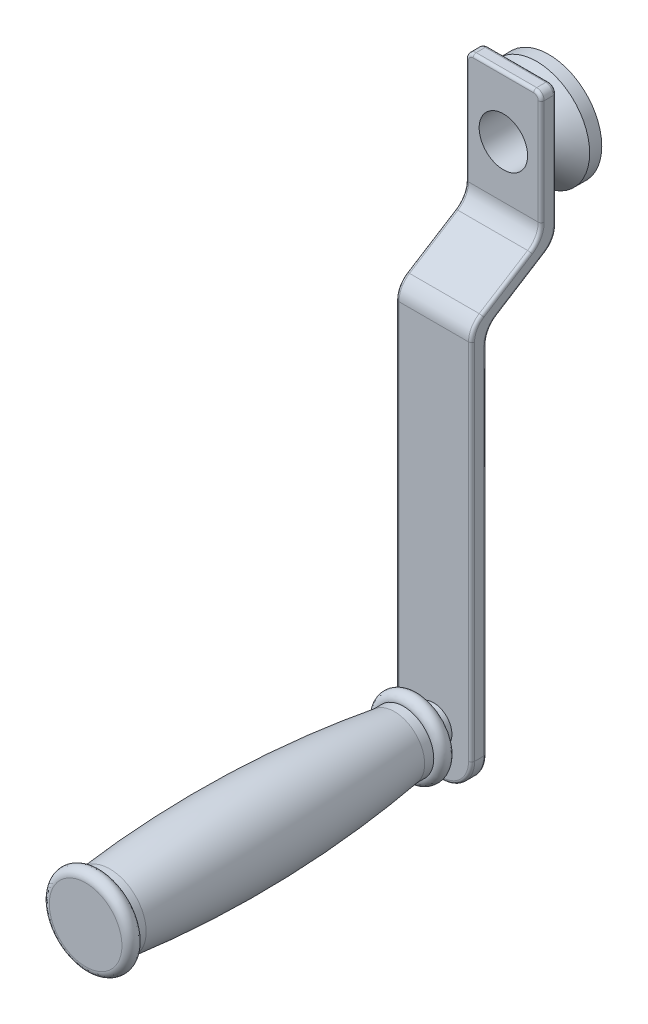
ISO-10303-21;
HEADER;
FILE_DESCRIPTION(('STEP AP214'),'2;1');
FILE_NAME('part.step','',(''),(''),'','','');
FILE_SCHEMA(('AUTOMOTIVE_DESIGN { 1 0 10303 214 1 1 1 1 }'));
ENDSEC;
DATA;
#1=APPLICATION_CONTEXT('core data for automotive mechanical design processes');
#2=APPLICATION_PROTOCOL_DEFINITION('international standard','automotive_design',2000,#1);
#3=PRODUCT_CONTEXT('',#1,'mechanical');
#4=PRODUCT('Part','Part','',(#3));
#5=PRODUCT_RELATED_PRODUCT_CATEGORY('part','',(#4));
#6=PRODUCT_DEFINITION_FORMATION('','',#4);
#7=PRODUCT_DEFINITION_CONTEXT('part definition',#1,'design');
#8=PRODUCT_DEFINITION('design','',#6,#7);
#9=PRODUCT_DEFINITION_SHAPE('','',#8);
#10=(LENGTH_UNIT() NAMED_UNIT(*) SI_UNIT(.MILLI.,.METRE.));
#11=(NAMED_UNIT(*) PLANE_ANGLE_UNIT() SI_UNIT($,.RADIAN.));
#12=(NAMED_UNIT(*) SI_UNIT($,.STERADIAN.) SOLID_ANGLE_UNIT());
#13=UNCERTAINTY_MEASURE_WITH_UNIT(LENGTH_MEASURE(1.E-05),#10,'distance_accuracy_value','');
#14=(GEOMETRIC_REPRESENTATION_CONTEXT(3) GLOBAL_UNCERTAINTY_ASSIGNED_CONTEXT((#13)) GLOBAL_UNIT_ASSIGNED_CONTEXT((#10,
#11,#12)) REPRESENTATION_CONTEXT('',''));
#15=CARTESIAN_POINT('',(0.,0.,0.));
#16=DIRECTION('',(0.,0.,1.));
#17=DIRECTION('',(1.,0.,0.));
#18=AXIS2_PLACEMENT_3D('',#15,#16,#17);
#19=CARTESIAN_POINT('',(12.5,0.,-28.));
#20=DIRECTION('',(0.,-1.,0.));
#21=DIRECTION('',(0.,0.,-1.));
#22=AXIS2_PLACEMENT_3D('',#19,#20,#21);
#23=PLANE('',#22);
#24=DIRECTION('',(0.,0.,1.));
#25=VECTOR('',#24,1.);
#26=CARTESIAN_POINT('',(-2.5,0.,-28.));
#27=LINE('',#26,#25);
#28=CARTESIAN_POINT('',(-2.5,0.,-1.));
#29=VERTEX_POINT('',#28);
#30=CARTESIAN_POINT('',(-2.5,0.,-4.));
#31=VERTEX_POINT('',#30);
#32=EDGE_CURVE('E500',#29,#31,#27,.F.);
#33=ORIENTED_EDGE('',*,*,#32,.T.);
#34=DIRECTION('',(1.,0.,0.));
#35=VECTOR('',#34,1.);
#36=CARTESIAN_POINT('',(2.5,0.,-4.));
#37=LINE('',#36,#35);
#38=CARTESIAN_POINT('',(2.5,0.,-4.));
#39=VERTEX_POINT('',#38);
#40=EDGE_CURVE('E481',#31,#39,#37,.T.);
#41=ORIENTED_EDGE('',*,*,#40,.T.);
#42=DIRECTION('',(0.,0.,1.));
#43=VECTOR('',#42,1.);
#44=CARTESIAN_POINT('',(2.5,0.,0.));
#45=LINE('',#44,#43);
#46=CARTESIAN_POINT('',(2.5,0.,-1.));
#47=VERTEX_POINT('',#46);
#48=EDGE_CURVE('E503',#39,#47,#45,.T.);
#49=ORIENTED_EDGE('',*,*,#48,.T.);
#50=DIRECTION('',(-1.,0.,0.));
#51=VECTOR('',#50,1.);
#52=CARTESIAN_POINT('',(12.5,0.,-1.));
#53=LINE('',#52,#51);
#54=EDGE_CURVE('E483',#47,#29,#53,.T.);
#55=ORIENTED_EDGE('',*,*,#54,.T.);
#56=EDGE_LOOP('',(#33,#41,#49,#55));
#57=FACE_BOUND('',#56,.T.);
#58=ADVANCED_FACE('F38',(#57),#23,.T.);
#59=CARTESIAN_POINT('',(12.5,190.,-28.));
#60=DIRECTION('',(0.,0.,-1.));
#61=DIRECTION('',(-1.,0.,0.));
#62=AXIS2_PLACEMENT_3D('',#59,#60,#61);
#63=PLANE('',#62);
#64=DIRECTION('',(-1.,0.,0.));
#65=VECTOR('',#64,1.);
#66=CARTESIAN_POINT('',(-12.5,149.999999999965,-28.));
#67=LINE('',#66,#65);
#68=CARTESIAN_POINT('',(11.5,149.999999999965,-28.));
#69=VERTEX_POINT('',#68);
#70=CARTESIAN_POINT('',(-11.5,149.999999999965,-28.));
#71=VERTEX_POINT('',#70);
#72=EDGE_CURVE('E512',#69,#71,#67,.T.);
#73=ORIENTED_EDGE('',*,*,#72,.T.);
#74=DIRECTION('',(0.,-1.,0.));
#75=VECTOR('',#74,1.);
#76=CARTESIAN_POINT('',(-11.5,190.,-28.));
#77=LINE('',#76,#75);
#78=CARTESIAN_POINT('',(-11.5,187.5,-28.));
#79=VERTEX_POINT('',#78);
#80=EDGE_CURVE('E420',#71,#79,#77,.F.);
#81=ORIENTED_EDGE('',*,*,#80,.T.);
#82=CARTESIAN_POINT('',(-10.,187.5,-28.));
#83=DIRECTION('',(0.,0.,-1.));
#84=DIRECTION('',(-1.,0.,0.));
#85=AXIS2_PLACEMENT_3D('',#82,#83,#84);
#86=CIRCLE('',#85,1.5);
#87=CARTESIAN_POINT('',(-10.,189.,-28.));
#88=VERTEX_POINT('',#87);
#89=EDGE_CURVE('E422',#79,#88,#86,.T.);
#90=ORIENTED_EDGE('',*,*,#89,.T.);
#91=DIRECTION('',(-1.,0.,0.));
#92=VECTOR('',#91,1.);
#93=CARTESIAN_POINT('',(12.5,189.,-28.));
#94=LINE('',#93,#92);
#95=CARTESIAN_POINT('',(10.,189.,-28.));
#96=VERTEX_POINT('',#95);
#97=EDGE_CURVE('E426',#88,#96,#94,.F.);
#98=ORIENTED_EDGE('',*,*,#97,.T.);
#99=CARTESIAN_POINT('',(10.,187.5,-28.));
#100=DIRECTION('',(0.,0.,-1.));
#101=DIRECTION('',(-1.,0.,0.));
#102=AXIS2_PLACEMENT_3D('',#99,#100,#101);
#103=CIRCLE('',#102,1.5);
#104=CARTESIAN_POINT('',(11.5,187.5,-28.));
#105=VERTEX_POINT('',#104);
#106=EDGE_CURVE('E428',#96,#105,#103,.T.);
#107=ORIENTED_EDGE('',*,*,#106,.T.);
#108=DIRECTION('',(0.,-1.,0.));
#109=VECTOR('',#108,1.);
#110=CARTESIAN_POINT('',(11.5,149.999999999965,-28.));
#111=LINE('',#110,#109);
#112=EDGE_CURVE('E424',#105,#69,#111,.T.);
#113=ORIENTED_EDGE('',*,*,#112,.T.);
#114=EDGE_LOOP('',(#73,#81,#90,#98,#107,#113));
#115=FACE_BOUND('',#114,.T.);
#116=CARTESIAN_POINT('',(0.,170.,-28.));
#117=DIRECTION('',(0.,0.,-1.));
#118=DIRECTION('',(-1.,0.,0.));
#119=AXIS2_PLACEMENT_3D('',#116,#117,#118);
#120=CIRCLE('',#119,10.0000000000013);
#121=CARTESIAN_POINT('',(-10.0000000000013,170.,-28.));
#122=VERTEX_POINT('',#121);
#123=EDGE_CURVE('E539',#122,#122,#120,.T.);
#124=ORIENTED_EDGE('',*,*,#123,.F.);
#125=EDGE_LOOP('',(#124));
#126=FACE_BOUND('',#125,.T.);
#127=ADVANCED_FACE('F628',(#115,#126),#63,.T.);
#128=CARTESIAN_POINT('',(12.5,190.,0.));
#129=DIRECTION('',(0.,1.,0.));
#130=DIRECTION('',(0.,0.,1.));
#131=AXIS2_PLACEMENT_3D('',#128,#129,#130);
#132=PLANE('',#131);
#133=DIRECTION('',(0.,0.,-1.));
#134=VECTOR('',#133,1.);
#135=CARTESIAN_POINT('',(10.,190.,-28.));
#136=LINE('',#135,#134);
#137=CARTESIAN_POINT('',(10.,190.,-24.));
#138=VERTEX_POINT('',#137);
#139=CARTESIAN_POINT('',(10.,190.,-27.));
#140=VERTEX_POINT('',#139);
#141=EDGE_CURVE('E533',#138,#140,#136,.T.);
#142=ORIENTED_EDGE('',*,*,#141,.T.);
#143=DIRECTION('',(-1.,0.,0.));
#144=VECTOR('',#143,1.);
#145=CARTESIAN_POINT('',(12.5,190.,-27.));
#146=LINE('',#145,#144);
#147=CARTESIAN_POINT('',(-10.,190.,-27.));
#148=VERTEX_POINT('',#147);
#149=EDGE_CURVE('E412',#140,#148,#146,.T.);
#150=ORIENTED_EDGE('',*,*,#149,.T.);
#151=DIRECTION('',(0.,0.,-1.));
#152=VECTOR('',#151,1.);
#153=CARTESIAN_POINT('',(-10.,190.,0.));
#154=LINE('',#153,#152);
#155=CARTESIAN_POINT('',(-10.,190.,-24.));
#156=VERTEX_POINT('',#155);
#157=EDGE_CURVE('E536',#148,#156,#154,.F.);
#158=ORIENTED_EDGE('',*,*,#157,.T.);
#159=DIRECTION('',(1.,0.,0.));
#160=VECTOR('',#159,1.);
#161=CARTESIAN_POINT('',(10.,190.,-24.));
#162=LINE('',#161,#160);
#163=EDGE_CURVE('E414',#156,#138,#162,.T.);
#164=ORIENTED_EDGE('',*,*,#163,.T.);
#165=EDGE_LOOP('',(#142,#150,#158,#164));
#166=FACE_BOUND('',#165,.T.);
#167=ADVANCED_FACE('F631',(#166),#132,.T.);
#168=CARTESIAN_POINT('',(12.5,0.,0.));
#169=DIRECTION('',(0.,0.,1.));
#170=DIRECTION('',(1.,0.,0.));
#171=AXIS2_PLACEMENT_3D('',#168,#169,#170);
#172=PLANE('',#171);
#173=CARTESIAN_POINT('',(0.,15.,0.));
#174=DIRECTION('',(0.,0.,1.));
#175=DIRECTION('',(1.,0.,0.));
#176=AXIS2_PLACEMENT_3D('',#173,#174,#175);
#177=CIRCLE('',#176,6.);
#178=CARTESIAN_POINT('',(6.,15.,0.));
#179=VERTEX_POINT('',#178);
#180=EDGE_CURVE('E542',#179,#179,#177,.T.);
#181=ORIENTED_EDGE('',*,*,#180,.F.);
#182=EDGE_LOOP('',(#181));
#183=FACE_BOUND('',#182,.T.);
#184=DIRECTION('',(-1.,0.,0.));
#185=VECTOR('',#184,1.);
#186=CARTESIAN_POINT('',(-12.5,130.000000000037,0.));
#187=LINE('',#186,#185);
#188=CARTESIAN_POINT('',(11.5,130.000000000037,0.));
#189=VERTEX_POINT('',#188);
#190=CARTESIAN_POINT('',(-11.5,130.000000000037,0.));
#191=VERTEX_POINT('',#190);
#192=EDGE_CURVE('E509',#189,#191,#187,.T.);
#193=ORIENTED_EDGE('',*,*,#192,.T.);
#194=DIRECTION('',(0.,1.,0.));
#195=VECTOR('',#194,1.);
#196=CARTESIAN_POINT('',(-11.5,0.,0.));
#197=LINE('',#196,#195);
#198=CARTESIAN_POINT('',(-11.5,10.,0.));
#199=VERTEX_POINT('',#198);
#200=EDGE_CURVE('E397',#191,#199,#197,.F.);
#201=ORIENTED_EDGE('',*,*,#200,.T.);
#202=CARTESIAN_POINT('',(-2.5,10.,0.));
#203=DIRECTION('',(0.,0.,1.));
#204=DIRECTION('',(1.,0.,0.));
#205=AXIS2_PLACEMENT_3D('',#202,#203,#204);
#206=CIRCLE('',#205,9.);
#207=CARTESIAN_POINT('',(-2.5,1.,0.));
#208=VERTEX_POINT('',#207);
#209=EDGE_CURVE('E399',#199,#208,#206,.T.);
#210=ORIENTED_EDGE('',*,*,#209,.T.);
#211=DIRECTION('',(-1.,0.,0.));
#212=VECTOR('',#211,1.);
#213=CARTESIAN_POINT('',(12.5,1.,0.));
#214=LINE('',#213,#212);
#215=CARTESIAN_POINT('',(2.5,1.,0.));
#216=VERTEX_POINT('',#215);
#217=EDGE_CURVE('E402',#208,#216,#214,.F.);
#218=ORIENTED_EDGE('',*,*,#217,.T.);
#219=CARTESIAN_POINT('',(2.5,10.,0.));
#220=DIRECTION('',(0.,0.,1.));
#221=DIRECTION('',(1.,0.,0.));
#222=AXIS2_PLACEMENT_3D('',#219,#220,#221);
#223=CIRCLE('',#222,9.);
#224=CARTESIAN_POINT('',(11.5,10.,0.));
#225=VERTEX_POINT('',#224);
#226=EDGE_CURVE('E404',#216,#225,#223,.T.);
#227=ORIENTED_EDGE('',*,*,#226,.T.);
#228=DIRECTION('',(0.,1.,0.));
#229=VECTOR('',#228,1.);
#230=CARTESIAN_POINT('',(11.5,130.000000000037,0.));
#231=LINE('',#230,#229);
#232=EDGE_CURVE('E406',#225,#189,#231,.T.);
#233=ORIENTED_EDGE('',*,*,#232,.T.);
#234=EDGE_LOOP('',(#193,#201,#210,#218,#227,#233));
#235=FACE_BOUND('',#234,.T.);
#236=ADVANCED_FACE('F623',(#183,#235),#172,.T.);
#237=CARTESIAN_POINT('',(12.5,0.,0.));
#238=DIRECTION('',(-1.,0.,0.));
#239=DIRECTION('',(0.,0.,1.));
#240=AXIS2_PLACEMENT_3D('',#237,#238,#239);
#241=PLANE('',#240);
#242=DIRECTION('',(0.,0.,1.));
#243=VECTOR('',#242,1.);
#244=CARTESIAN_POINT('',(12.5,10.,-5.));
#245=LINE('',#244,#243);
#246=CARTESIAN_POINT('',(12.5,10.,-1.));
#247=VERTEX_POINT('',#246);
#248=CARTESIAN_POINT('',(12.5,10.,-4.));
#249=VERTEX_POINT('',#248);
#250=EDGE_CURVE('E497',#247,#249,#245,.F.);
#251=ORIENTED_EDGE('',*,*,#250,.T.);
#252=DIRECTION('',(0.,-1.,0.));
#253=VECTOR('',#252,1.);
#254=CARTESIAN_POINT('',(12.5,0.,-4.));
#255=LINE('',#254,#253);
#256=CARTESIAN_POINT('',(12.5,127.239320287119,-4.));
#257=VERTEX_POINT('',#256);
#258=EDGE_CURVE('E438',#249,#257,#255,.F.);
#259=ORIENTED_EDGE('',*,*,#258,.T.);
#260=CARTESIAN_POINT('',(12.5,127.239320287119,-12.5));
#261=DIRECTION('',(-1.,0.,0.));
#262=DIRECTION('',(0.,0.,1.));
#263=AXIS2_PLACEMENT_3D('',#260,#261,#262);
#264=CIRCLE('',#263,8.5);
#265=CARTESIAN_POINT('',(12.5,134.432700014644,-7.97172349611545));
#266=VERTEX_POINT('',#265);
#267=EDGE_CURVE('E440',#257,#266,#264,.T.);
#268=ORIENTED_EDGE('',*,*,#267,.T.);
#269=DIRECTION('',(0.,0.532738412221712,-0.846279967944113));
#270=VECTOR('',#269,1.);
#271=CARTESIAN_POINT('',(12.5,92.6853079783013,58.3459678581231));
#272=LINE('',#271,#270);
#273=CARTESIAN_POINT('',(12.5,144.499180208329,-23.9627996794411));
#274=VERTEX_POINT('',#273);
#275=EDGE_CURVE('E442',#266,#274,#272,.T.);
#276=ORIENTED_EDGE('',*,*,#275,.T.);
#277=CARTESIAN_POINT('',(12.5,149.999999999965,-20.5));
#278=DIRECTION('',(-1.,0.,0.));
#279=DIRECTION('',(0.,0.,1.));
#280=AXIS2_PLACEMENT_3D('',#277,#278,#279);
#281=CIRCLE('',#280,6.5);
#282=CARTESIAN_POINT('',(12.5,149.999999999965,-27.));
#283=VERTEX_POINT('',#282);
#284=EDGE_CURVE('E444',#274,#283,#281,.F.);
#285=ORIENTED_EDGE('',*,*,#284,.T.);
#286=DIRECTION('',(0.,-1.,0.));
#287=VECTOR('',#286,1.);
#288=CARTESIAN_POINT('',(12.5,187.5,-27.));
#289=LINE('',#288,#287);
#290=CARTESIAN_POINT('',(12.5,187.5,-27.));
#291=VERTEX_POINT('',#290);
#292=EDGE_CURVE('E446',#283,#291,#289,.F.);
#293=ORIENTED_EDGE('',*,*,#292,.T.);
#294=DIRECTION('',(0.,0.,-1.));
#295=VECTOR('',#294,1.);
#296=CARTESIAN_POINT('',(12.5,187.5,-23.));
#297=LINE('',#296,#295);
#298=CARTESIAN_POINT('',(12.5,187.5,-24.));
#299=VERTEX_POINT('',#298);
#300=EDGE_CURVE('E530',#291,#299,#297,.F.);
#301=ORIENTED_EDGE('',*,*,#300,.T.);
#302=DIRECTION('',(0.,1.,0.));
#303=VECTOR('',#302,1.);
#304=CARTESIAN_POINT('',(12.5,0.,-24.));
#305=LINE('',#304,#303);
#306=CARTESIAN_POINT('',(12.5,152.760679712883,-24.));
#307=VERTEX_POINT('',#306);
#308=EDGE_CURVE('E279',#299,#307,#305,.F.);
#309=ORIENTED_EDGE('',*,*,#308,.T.);
#310=CARTESIAN_POINT('',(12.5,152.760679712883,-15.5));
#311=DIRECTION('',(-1.,0.,0.));
#312=DIRECTION('',(0.,0.,1.));
#313=AXIS2_PLACEMENT_3D('',#310,#311,#312);
#314=CIRCLE('',#313,8.5);
#315=CARTESIAN_POINT('',(12.5,145.567299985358,-20.0282765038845));
#316=VERTEX_POINT('',#315);
#317=EDGE_CURVE('E454',#307,#316,#314,.T.);
#318=ORIENTED_EDGE('',*,*,#317,.T.);
#319=DIRECTION('',(0.,-0.532738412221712,0.846279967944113));
#320=VECTOR('',#319,1.);
#321=CARTESIAN_POINT('',(12.5,95.2241478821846,59.9441830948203));
#322=LINE('',#321,#320);
#323=CARTESIAN_POINT('',(12.5,135.500819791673,-4.03720032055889));
#324=VERTEX_POINT('',#323);
#325=EDGE_CURVE('E452',#316,#324,#322,.T.);
#326=ORIENTED_EDGE('',*,*,#325,.T.);
#327=CARTESIAN_POINT('',(12.5,130.000000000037,-7.5));
#328=DIRECTION('',(-1.,0.,0.));
#329=DIRECTION('',(0.,0.,1.));
#330=AXIS2_PLACEMENT_3D('',#327,#328,#329);
#331=CIRCLE('',#330,6.5);
#332=CARTESIAN_POINT('',(12.5,130.000000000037,-1.));
#333=VERTEX_POINT('',#332);
#334=EDGE_CURVE('E450',#324,#333,#331,.F.);
#335=ORIENTED_EDGE('',*,*,#334,.T.);
#336=DIRECTION('',(0.,1.,0.));
#337=VECTOR('',#336,1.);
#338=CARTESIAN_POINT('',(12.5,10.,-1.));
#339=LINE('',#338,#337);
#340=EDGE_CURVE('E448',#333,#247,#339,.F.);
#341=ORIENTED_EDGE('',*,*,#340,.T.);
#342=EDGE_LOOP('',(#251,#259,#268,#276,#285,#293,#301,#309,#318,#326,#335,#341));
#343=FACE_BOUND('',#342,.T.);
#344=ADVANCED_FACE('F619',(#343),#241,.F.);
#345=CARTESIAN_POINT('',(-12.5,0.,0.));
#346=DIRECTION('',(-1.,0.,0.));
#347=DIRECTION('',(0.,0.,1.));
#348=AXIS2_PLACEMENT_3D('',#345,#346,#347);
#349=PLANE('',#348);
#350=CARTESIAN_POINT('',(-12.5,127.239320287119,-12.5));
#351=DIRECTION('',(-1.,0.,0.));
#352=DIRECTION('',(0.,0.,1.));
#353=AXIS2_PLACEMENT_3D('',#350,#351,#352);
#354=CIRCLE('',#353,8.5);
#355=CARTESIAN_POINT('',(-12.5,134.432700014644,-7.97172349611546));
#356=VERTEX_POINT('',#355);
#357=CARTESIAN_POINT('',(-12.5,127.239320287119,-4.));
#358=VERTEX_POINT('',#357);
#359=EDGE_CURVE('E463',#356,#358,#354,.F.);
#360=ORIENTED_EDGE('',*,*,#359,.T.);
#361=DIRECTION('',(0.,-1.,0.));
#362=VECTOR('',#361,1.);
#363=CARTESIAN_POINT('',(-12.5,9.99999999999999,-4.));
#364=LINE('',#363,#362);
#365=CARTESIAN_POINT('',(-12.5,10.,-4.));
#366=VERTEX_POINT('',#365);
#367=EDGE_CURVE('E282',#358,#366,#364,.T.);
#368=ORIENTED_EDGE('',*,*,#367,.T.);
#369=DIRECTION('',(0.,0.,1.));
#370=VECTOR('',#369,1.);
#371=CARTESIAN_POINT('',(-12.5,10.,0.));
#372=LINE('',#371,#370);
#373=CARTESIAN_POINT('',(-12.5,10.,-1.));
#374=VERTEX_POINT('',#373);
#375=EDGE_CURVE('E506',#366,#374,#372,.T.);
#376=ORIENTED_EDGE('',*,*,#375,.T.);
#377=DIRECTION('',(0.,1.,0.));
#378=VECTOR('',#377,1.);
#379=CARTESIAN_POINT('',(-12.5,0.,-1.));
#380=LINE('',#379,#378);
#381=CARTESIAN_POINT('',(-12.5,130.000000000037,-1.));
#382=VERTEX_POINT('',#381);
#383=EDGE_CURVE('E471',#374,#382,#380,.T.);
#384=ORIENTED_EDGE('',*,*,#383,.T.);
#385=CARTESIAN_POINT('',(-12.5,130.000000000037,-7.5));
#386=DIRECTION('',(-1.,0.,0.));
#387=DIRECTION('',(0.,0.,1.));
#388=AXIS2_PLACEMENT_3D('',#385,#386,#387);
#389=CIRCLE('',#388,6.5);
#390=CARTESIAN_POINT('',(-12.5,135.500819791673,-4.03720032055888));
#391=VERTEX_POINT('',#390);
#392=EDGE_CURVE('E473',#382,#391,#389,.T.);
#393=ORIENTED_EDGE('',*,*,#392,.T.);
#394=DIRECTION('',(0.,-0.532738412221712,0.846279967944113));
#395=VECTOR('',#394,1.);
#396=CARTESIAN_POINT('',(-12.5,145.567299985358,-20.0282765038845));
#397=LINE('',#396,#395);
#398=CARTESIAN_POINT('',(-12.5,145.567299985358,-20.0282765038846));
#399=VERTEX_POINT('',#398);
#400=EDGE_CURVE('E475',#391,#399,#397,.F.);
#401=ORIENTED_EDGE('',*,*,#400,.T.);
#402=CARTESIAN_POINT('',(-12.5,152.760679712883,-15.5));
#403=DIRECTION('',(-1.,0.,0.));
#404=DIRECTION('',(0.,0.,1.));
#405=AXIS2_PLACEMENT_3D('',#402,#403,#404);
#406=CIRCLE('',#405,8.5);
#407=CARTESIAN_POINT('',(-12.5,152.760679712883,-24.));
#408=VERTEX_POINT('',#407);
#409=EDGE_CURVE('E477',#399,#408,#406,.F.);
#410=ORIENTED_EDGE('',*,*,#409,.T.);
#411=DIRECTION('',(0.,1.,0.));
#412=VECTOR('',#411,1.);
#413=CARTESIAN_POINT('',(-12.5,187.5,-24.));
#414=LINE('',#413,#412);
#415=CARTESIAN_POINT('',(-12.5,187.5,-24.));
#416=VERTEX_POINT('',#415);
#417=EDGE_CURVE('E479',#408,#416,#414,.T.);
#418=ORIENTED_EDGE('',*,*,#417,.T.);
#419=DIRECTION('',(0.,0.,-1.));
#420=VECTOR('',#419,1.);
#421=CARTESIAN_POINT('',(-12.5,187.5,0.));
#422=LINE('',#421,#420);
#423=CARTESIAN_POINT('',(-12.5,187.5,-27.));
#424=VERTEX_POINT('',#423);
#425=EDGE_CURVE('E527',#416,#424,#422,.T.);
#426=ORIENTED_EDGE('',*,*,#425,.T.);
#427=DIRECTION('',(0.,-1.,0.));
#428=VECTOR('',#427,1.);
#429=CARTESIAN_POINT('',(-12.5,0.,-27.));
#430=LINE('',#429,#428);
#431=CARTESIAN_POINT('',(-12.5,149.999999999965,-27.));
#432=VERTEX_POINT('',#431);
#433=EDGE_CURVE('E469',#424,#432,#430,.T.);
#434=ORIENTED_EDGE('',*,*,#433,.T.);
#435=CARTESIAN_POINT('',(-12.5,149.999999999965,-20.5));
#436=DIRECTION('',(-1.,0.,0.));
#437=DIRECTION('',(0.,0.,1.));
#438=AXIS2_PLACEMENT_3D('',#435,#436,#437);
#439=CIRCLE('',#438,6.5);
#440=CARTESIAN_POINT('',(-12.5,144.499180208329,-23.9627996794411));
#441=VERTEX_POINT('',#440);
#442=EDGE_CURVE('E467',#432,#441,#439,.T.);
#443=ORIENTED_EDGE('',*,*,#442,.T.);
#444=DIRECTION('',(0.,0.532738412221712,-0.846279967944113));
#445=VECTOR('',#444,1.);
#446=CARTESIAN_POINT('',(-12.5,134.432700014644,-7.97172349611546));
#447=LINE('',#446,#445);
#448=EDGE_CURVE('E465',#441,#356,#447,.F.);
#449=ORIENTED_EDGE('',*,*,#448,.T.);
#450=EDGE_LOOP('',(#360,#368,#376,#384,#393,#401,#410,#418,#426,#434,#443,#449));
#451=FACE_BOUND('',#450,.T.);
#452=ADVANCED_FACE('F622',(#451),#349,.T.);
#453=CARTESIAN_POINT('',(-12.5,134.141019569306,0.));
#454=DIRECTION('',(0.,0.846279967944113,0.532738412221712));
#455=DIRECTION('',(0.,-0.532738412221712,0.846279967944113));
#456=AXIS2_PLACEMENT_3D('',#453,#454,#455);
#457=PLANE('',#456);
#458=DIRECTION('',(1.,0.,0.));
#459=VECTOR('',#458,1.);
#460=CARTESIAN_POINT('',(-12.5,146.413579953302,-19.4955380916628));
#461=LINE('',#460,#459);
#462=CARTESIAN_POINT('',(11.5,146.413579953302,-19.4955380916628));
#463=VERTEX_POINT('',#462);
#464=CARTESIAN_POINT('',(-11.5,146.413579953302,-19.4955380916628));
#465=VERTEX_POINT('',#464);
#466=EDGE_CURVE('E268',#463,#465,#461,.F.);
#467=ORIENTED_EDGE('',*,*,#466,.T.);
#468=DIRECTION('',(0.,0.532738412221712,-0.846279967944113));
#469=VECTOR('',#468,1.);
#470=CARTESIAN_POINT('',(-11.5,136.347099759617,-3.50446190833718));
#471=LINE('',#470,#469);
#472=CARTESIAN_POINT('',(-11.5,136.347099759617,-3.50446190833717));
#473=VERTEX_POINT('',#472);
#474=EDGE_CURVE('E389',#465,#473,#471,.F.);
#475=ORIENTED_EDGE('',*,*,#474,.T.);
#476=DIRECTION('',(1.,0.,0.));
#477=VECTOR('',#476,1.);
#478=CARTESIAN_POINT('',(12.5,136.347099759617,-3.50446190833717));
#479=LINE('',#478,#477);
#480=CARTESIAN_POINT('',(11.5,136.347099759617,-3.50446190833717));
#481=VERTEX_POINT('',#480);
#482=EDGE_CURVE('E521',#473,#481,#479,.T.);
#483=ORIENTED_EDGE('',*,*,#482,.T.);
#484=DIRECTION('',(0.,0.532738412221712,-0.846279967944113));
#485=VECTOR('',#484,1.);
#486=CARTESIAN_POINT('',(11.5,134.141019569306,0.));
#487=LINE('',#486,#485);
#488=EDGE_CURVE('E391',#481,#463,#487,.T.);
#489=ORIENTED_EDGE('',*,*,#488,.T.);
#490=EDGE_LOOP('',(#467,#475,#483,#489));
#491=FACE_BOUND('',#490,.T.);
#492=ADVANCED_FACE('F617',(#491),#457,.T.);
#493=CARTESIAN_POINT('',(-12.5,134.141019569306,-23.));
#494=DIRECTION('',(0.,0.,-1.));
#495=DIRECTION('',(-1.,0.,0.));
#496=AXIS2_PLACEMENT_3D('',#493,#494,#495);
#497=PLANE('',#496);
#498=CARTESIAN_POINT('',(0.,170.,-23.));
#499=DIRECTION('',(0.,0.,1.));
#500=DIRECTION('',(1.,0.,0.));
#501=AXIS2_PLACEMENT_3D('',#498,#499,#500);
#502=CIRCLE('',#501,7.99999999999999);
#503=CARTESIAN_POINT('',(7.99999999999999,170.,-23.));
#504=VERTEX_POINT('',#503);
#505=EDGE_CURVE('E326',#504,#504,#502,.T.);
#506=ORIENTED_EDGE('',*,*,#505,.F.);
#507=EDGE_LOOP('',(#506));
#508=FACE_BOUND('',#507,.T.);
#509=CARTESIAN_POINT('',(-10.,187.5,-23.));
#510=DIRECTION('',(0.,0.,-1.));
#511=DIRECTION('',(-1.,0.,0.));
#512=AXIS2_PLACEMENT_3D('',#509,#510,#511);
#513=CIRCLE('',#512,1.5);
#514=CARTESIAN_POINT('',(-10.,189.,-23.));
#515=VERTEX_POINT('',#514);
#516=CARTESIAN_POINT('',(-11.5,187.5,-23.));
#517=VERTEX_POINT('',#516);
#518=EDGE_CURVE('E47',#515,#517,#513,.F.);
#519=ORIENTED_EDGE('',*,*,#518,.T.);
#520=DIRECTION('',(0.,1.,0.));
#521=VECTOR('',#520,1.);
#522=CARTESIAN_POINT('',(-11.5,152.760679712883,-23.));
#523=LINE('',#522,#521);
#524=CARTESIAN_POINT('',(-11.5,152.760679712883,-23.));
#525=VERTEX_POINT('',#524);
#526=EDGE_CURVE('E11',#517,#525,#523,.F.);
#527=ORIENTED_EDGE('',*,*,#526,.T.);
#528=DIRECTION('',(-1.,0.,0.));
#529=VECTOR('',#528,1.);
#530=CARTESIAN_POINT('',(12.5,152.760679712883,-23.));
#531=LINE('',#530,#529);
#532=CARTESIAN_POINT('',(11.5,152.760679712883,-23.));
#533=VERTEX_POINT('',#532);
#534=EDGE_CURVE('E524',#525,#533,#531,.F.);
#535=ORIENTED_EDGE('',*,*,#534,.T.);
#536=DIRECTION('',(0.,1.,0.));
#537=VECTOR('',#536,1.);
#538=CARTESIAN_POINT('',(11.5,134.141019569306,-23.));
#539=LINE('',#538,#537);
#540=CARTESIAN_POINT('',(11.5,187.5,-23.));
#541=VERTEX_POINT('',#540);
#542=EDGE_CURVE('E381',#533,#541,#539,.T.);
#543=ORIENTED_EDGE('',*,*,#542,.T.);
#544=CARTESIAN_POINT('',(10.,187.5,-23.));
#545=DIRECTION('',(0.,0.,-1.));
#546=DIRECTION('',(-1.,0.,0.));
#547=AXIS2_PLACEMENT_3D('',#544,#545,#546);
#548=CIRCLE('',#547,1.5);
#549=CARTESIAN_POINT('',(10.,189.,-23.));
#550=VERTEX_POINT('',#549);
#551=EDGE_CURVE('E383',#541,#550,#548,.F.);
#552=ORIENTED_EDGE('',*,*,#551,.T.);
#553=DIRECTION('',(1.,0.,0.));
#554=VECTOR('',#553,1.);
#555=CARTESIAN_POINT('',(-10.,189.,-23.));
#556=LINE('',#555,#554);
#557=EDGE_CURVE('E58',#550,#515,#556,.F.);
#558=ORIENTED_EDGE('',*,*,#557,.T.);
#559=EDGE_LOOP('',(#519,#527,#535,#543,#552,#558));
#560=FACE_BOUND('',#559,.T.);
#561=ADVANCED_FACE('F613',(#508,#560),#497,.F.);
#562=CARTESIAN_POINT('',(-12.5,131.380339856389,-5.));
#563=DIRECTION('',(0.,0.,1.));
#564=DIRECTION('',(0.,-1.,0.));
#565=AXIS2_PLACEMENT_3D('',#562,#563,#564);
#566=PLANE('',#565);
#567=CARTESIAN_POINT('',(0.,15.,-5.));
#568=DIRECTION('',(0.,0.,-1.));
#569=DIRECTION('',(-1.,0.,0.));
#570=AXIS2_PLACEMENT_3D('',#567,#568,#569);
#571=CIRCLE('',#570,8.);
#572=CARTESIAN_POINT('',(-8.,15.,-5.));
#573=VERTEX_POINT('',#572);
#574=EDGE_CURVE('E566',#573,#573,#571,.T.);
#575=ORIENTED_EDGE('',*,*,#574,.F.);
#576=EDGE_LOOP('',(#575));
#577=FACE_BOUND('',#576,.T.);
#578=CARTESIAN_POINT('',(-2.5,10.,-5.));
#579=DIRECTION('',(0.,0.,1.));
#580=DIRECTION('',(0.,-1.,0.));
#581=AXIS2_PLACEMENT_3D('',#578,#579,#580);
#582=CIRCLE('',#581,9.);
#583=CARTESIAN_POINT('',(-2.5,1.,-5.));
#584=VERTEX_POINT('',#583);
#585=CARTESIAN_POINT('',(-11.5,10.,-5.));
#586=VERTEX_POINT('',#585);
#587=EDGE_CURVE('E253',#584,#586,#582,.F.);
#588=ORIENTED_EDGE('',*,*,#587,.T.);
#589=DIRECTION('',(0.,-1.,0.));
#590=VECTOR('',#589,1.);
#591=CARTESIAN_POINT('',(-11.5,127.239320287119,-5.));
#592=LINE('',#591,#590);
#593=CARTESIAN_POINT('',(-11.5,127.239320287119,-5.));
#594=VERTEX_POINT('',#593);
#595=EDGE_CURVE('E247',#586,#594,#592,.F.);
#596=ORIENTED_EDGE('',*,*,#595,.T.);
#597=DIRECTION('',(-1.,0.,0.));
#598=VECTOR('',#597,1.);
#599=CARTESIAN_POINT('',(12.5,127.239320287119,-5.));
#600=LINE('',#599,#598);
#601=CARTESIAN_POINT('',(11.5,127.239320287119,-5.));
#602=VERTEX_POINT('',#601);
#603=EDGE_CURVE('E250',#594,#602,#600,.F.);
#604=ORIENTED_EDGE('',*,*,#603,.T.);
#605=DIRECTION('',(0.,-1.,0.));
#606=VECTOR('',#605,1.);
#607=CARTESIAN_POINT('',(11.5,131.380339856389,-5.));
#608=LINE('',#607,#606);
#609=CARTESIAN_POINT('',(11.5,10.,-5.));
#610=VERTEX_POINT('',#609);
#611=EDGE_CURVE('E495',#602,#610,#608,.T.);
#612=ORIENTED_EDGE('',*,*,#611,.T.);
#613=CARTESIAN_POINT('',(2.5,10.,-5.));
#614=DIRECTION('',(0.,0.,1.));
#615=DIRECTION('',(0.,-1.,0.));
#616=AXIS2_PLACEMENT_3D('',#613,#614,#615);
#617=CIRCLE('',#616,9.);
#618=CARTESIAN_POINT('',(2.5,1.,-5.));
#619=VERTEX_POINT('',#618);
#620=EDGE_CURVE('E493',#610,#619,#617,.F.);
#621=ORIENTED_EDGE('',*,*,#620,.T.);
#622=DIRECTION('',(1.,0.,0.));
#623=VECTOR('',#622,1.);
#624=CARTESIAN_POINT('',(-2.5,1.,-5.));
#625=LINE('',#624,#623);
#626=EDGE_CURVE('E491',#619,#584,#625,.F.);
#627=ORIENTED_EDGE('',*,*,#626,.T.);
#628=EDGE_LOOP('',(#588,#596,#604,#612,#621,#627));
#629=FACE_BOUND('',#628,.T.);
#630=ADVANCED_FACE('F249',(#577,#629),#566,.F.);
#631=CARTESIAN_POINT('',(-12.5,131.380339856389,-5.));
#632=DIRECTION('',(0.,-0.846279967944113,-0.532738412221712));
#633=DIRECTION('',(0.,0.532738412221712,-0.846279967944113));
#634=AXIS2_PLACEMENT_3D('',#631,#632,#633);
#635=PLANE('',#634);
#636=DIRECTION('',(1.,0.,0.));
#637=VECTOR('',#636,1.);
#638=CARTESIAN_POINT('',(-12.5,133.5864200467,-8.50446190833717));
#639=LINE('',#638,#637);
#640=CARTESIAN_POINT('',(11.5,133.5864200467,-8.50446190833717));
#641=VERTEX_POINT('',#640);
#642=CARTESIAN_POINT('',(-11.5,133.5864200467,-8.50446190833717));
#643=VERTEX_POINT('',#642);
#644=EDGE_CURVE('E515',#641,#643,#639,.F.);
#645=ORIENTED_EDGE('',*,*,#644,.T.);
#646=DIRECTION('',(0.,-0.532738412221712,0.846279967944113));
#647=VECTOR('',#646,1.);
#648=CARTESIAN_POINT('',(-11.5,143.652900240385,-24.4955380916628));
#649=LINE('',#648,#647);
#650=CARTESIAN_POINT('',(-11.5,143.652900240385,-24.4955380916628));
#651=VERTEX_POINT('',#650);
#652=EDGE_CURVE('E434',#643,#651,#649,.F.);
#653=ORIENTED_EDGE('',*,*,#652,.T.);
#654=DIRECTION('',(1.,0.,0.));
#655=VECTOR('',#654,1.);
#656=CARTESIAN_POINT('',(12.5,143.652900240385,-24.4955380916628));
#657=LINE('',#656,#655);
#658=CARTESIAN_POINT('',(11.5,143.652900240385,-24.4955380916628));
#659=VERTEX_POINT('',#658);
#660=EDGE_CURVE('E267',#651,#659,#657,.T.);
#661=ORIENTED_EDGE('',*,*,#660,.T.);
#662=DIRECTION('',(0.,-0.532738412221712,0.846279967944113));
#663=VECTOR('',#662,1.);
#664=CARTESIAN_POINT('',(11.5,131.380339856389,-5.));
#665=LINE('',#664,#663);
#666=EDGE_CURVE('E436',#659,#641,#665,.T.);
#667=ORIENTED_EDGE('',*,*,#666,.T.);
#668=EDGE_LOOP('',(#645,#653,#661,#667));
#669=FACE_BOUND('',#668,.T.);
#670=ADVANCED_FACE('F609',(#669),#635,.T.);
#671=CARTESIAN_POINT('',(0.,15.,0.));
#672=DIRECTION('',(0.,0.,1.));
#673=DIRECTION('',(1.,0.,0.));
#674=AXIS2_PLACEMENT_3D('',#671,#672,#673);
#675=CYLINDRICAL_SURFACE('',#674,6.);
#676=ORIENTED_EDGE('',*,*,#180,.T.);
#677=EDGE_LOOP('',(#676));
#678=FACE_BOUND('',#677,.T.);
#679=CARTESIAN_POINT('',(0.,15.,5.));
#680=DIRECTION('',(0.,0.,1.));
#681=DIRECTION('',(1.,0.,0.));
#682=AXIS2_PLACEMENT_3D('',#679,#680,#681);
#683=CIRCLE('',#682,6.);
#684=CARTESIAN_POINT('',(6.,15.,5.));
#685=VERTEX_POINT('',#684);
#686=EDGE_CURVE('E563',#685,#685,#683,.T.);
#687=ORIENTED_EDGE('',*,*,#686,.F.);
#688=EDGE_LOOP('',(#687));
#689=FACE_BOUND('',#688,.T.);
#690=ADVANCED_FACE('F605',(#678,#689),#675,.T.);
#691=CARTESIAN_POINT('',(0.,15.,115.));
#692=DIRECTION('',(0.,0.,1.));
#693=DIRECTION('',(1.,0.,0.));
#694=AXIS2_PLACEMENT_3D('',#691,#692,#693);
#695=PLANE('',#694);
#696=CARTESIAN_POINT('',(0.,15.,115.));
#697=DIRECTION('',(0.,0.,1.));
#698=DIRECTION('',(1.,0.,0.));
#699=AXIS2_PLACEMENT_3D('',#696,#697,#698);
#700=CIRCLE('',#699,12.);
#701=CARTESIAN_POINT('',(12.,15.,115.));
#702=VERTEX_POINT('',#701);
#703=EDGE_CURVE('E545',#702,#702,#700,.T.);
#704=ORIENTED_EDGE('',*,*,#703,.T.);
#705=EDGE_LOOP('',(#704));
#706=FACE_BOUND('',#705,.T.);
#707=ADVANCED_FACE('F601',(#706),#695,.T.);
#708=CARTESIAN_POINT('',(12.,15.,115.));
#709=CARTESIAN_POINT('',(12.0876855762,15.,115.));
#710=CARTESIAN_POINT('',(12.1754922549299,15.,114.995373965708));
#711=CARTESIAN_POINT('',(12.2626924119,15.,114.986160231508));
#712=CARTESIAN_POINT('',(12.5409528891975,15.,114.956758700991));
#713=CARTESIAN_POINT('',(12.8179745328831,15.,114.878909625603));
#714=CARTESIAN_POINT('',(13.0708170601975,15.,114.759059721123));
#715=CARTESIAN_POINT('',(13.323659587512,15.,114.639209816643));
#716=CARTESIAN_POINT('',(13.5592967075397,15.,114.47405347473));
#717=CARTESIAN_POINT('',(13.758215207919,15.,114.277267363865));
#718=CARTESIAN_POINT('',(13.9571337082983,15.,114.080481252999));
#719=CARTESIAN_POINT('',(14.1248200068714,15.,113.846637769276));
#720=CARTESIAN_POINT('',(14.2473879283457,15.,113.595101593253));
#721=CARTESIAN_POINT('',(14.36995584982,15.,113.343565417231));
#722=CARTESIAN_POINT('',(14.4507859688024,15.,113.067398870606));
#723=CARTESIAN_POINT('',(14.4831847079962,15.,112.78947142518));
#724=CARTESIAN_POINT('',(14.51558344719,15.,112.511543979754));
#725=CARTESIAN_POINT('',(14.5004444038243,15.,112.224190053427));
#726=CARTESIAN_POINT('',(14.4390212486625,15.,111.951205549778));
#727=CARTESIAN_POINT('',(14.3775980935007,15.,111.678221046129));
#728=CARTESIAN_POINT('',(14.2681967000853,15.,111.412076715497));
#729=CARTESIAN_POINT('',(14.1198766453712,15.,111.174812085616));
#730=CARTESIAN_POINT('',(13.971556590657,15.,110.937547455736));
#731=CARTESIAN_POINT('',(13.7802270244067,15.,110.722618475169));
#732=CARTESIAN_POINT('',(13.561732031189,15.,110.547823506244));
#733=CARTESIAN_POINT('',(13.3432370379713,15.,110.37302853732));
#734=CARTESIAN_POINT('',(13.0915502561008,15.,110.233546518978));
#735=CARTESIAN_POINT('',(12.8275139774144,15.,110.140928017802));
#736=CARTESIAN_POINT('',(12.5634776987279,15.,110.048309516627));
#737=CARTESIAN_POINT('',(12.2798094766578,15.,110.));
#738=CARTESIAN_POINT('',(12.0000000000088,15.,110.));
#739=B_SPLINE_CURVE_WITH_KNOTS('',3,(#708,#709,#710,#711,#712,#713,#714,#715,#716,#717,#718,
#719,#720,#721,#722,#723,#724,#725,#726,#727,#728,#729,#730,#731,#732,#733,#734,#735,#736,#737,
#738),.UNSPECIFIED.,.F.,.F.,(4,3,3,3,3,3,3,3,3,3,4),(0.,0.000259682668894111,
0.00109911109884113,0.00193853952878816,0.00277796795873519,0.00361739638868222,
0.00445682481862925,0.00529625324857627,0.00613568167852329,0.00697511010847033,
0.00781453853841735),.UNSPECIFIED.);
#740=CARTESIAN_POINT('',(0.,15.,0.));
#741=DIRECTION('',(0.,0.,1.));
#742=AXIS1_PLACEMENT('',#740,#741);
#743=SURFACE_OF_REVOLUTION('',#739,#742);
#744=CARTESIAN_POINT('',(0.,15.,110.));
#745=DIRECTION('',(0.,0.,1.));
#746=DIRECTION('',(1.,0.,0.));
#747=AXIS2_PLACEMENT_3D('',#744,#745,#746);
#748=CIRCLE('',#747,12.0000000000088);
#749=CARTESIAN_POINT('',(12.0000000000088,15.,110.));
#750=VERTEX_POINT('',#749);
#751=EDGE_CURVE('E548',#750,#750,#748,.T.);
#752=ORIENTED_EDGE('',*,*,#751,.T.);
#753=EDGE_LOOP('',(#752));
#754=FACE_BOUND('',#753,.T.);
#755=ORIENTED_EDGE('',*,*,#703,.F.);
#756=EDGE_LOOP('',(#755));
#757=FACE_BOUND('',#756,.T.);
#758=ADVANCED_FACE('F597',(#754,#757),#743,.F.);
#759=CARTESIAN_POINT('',(0.,15.,0.));
#760=DIRECTION('',(0.,0.,1.));
#761=DIRECTION('',(1.,0.,0.));
#762=AXIS2_PLACEMENT_3D('',#759,#760,#761);
#763=CYLINDRICAL_SURFACE('',#762,12.0000000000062);
#764=CARTESIAN_POINT('',(0.,15.,107.));
#765=DIRECTION('',(0.,0.,1.));
#766=DIRECTION('',(1.,0.,0.));
#767=AXIS2_PLACEMENT_3D('',#764,#765,#766);
#768=CIRCLE('',#767,12.0000000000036);
#769=CARTESIAN_POINT('',(12.0000000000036,15.,107.));
#770=VERTEX_POINT('',#769);
#771=EDGE_CURVE('E551',#770,#770,#768,.T.);
#772=ORIENTED_EDGE('',*,*,#771,.T.);
#773=EDGE_LOOP('',(#772));
#774=FACE_BOUND('',#773,.T.);
#775=ORIENTED_EDGE('',*,*,#751,.F.);
#776=EDGE_LOOP('',(#775));
#777=FACE_BOUND('',#776,.T.);
#778=ADVANCED_FACE('F593',(#774,#777),#763,.T.);
#779=CARTESIAN_POINT('',(0.,15.,68.0338388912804));
#780=DIRECTION('',(0.,0.,1.));
#781=DIRECTION('',(1.,0.,0.));
#782=AXIS2_PLACEMENT_3D('',#779,#780,#781);
#783=DEGENERATE_TOROIDAL_SURFACE('',#782,366.59042788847,380.590427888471,.F.);
#784=CARTESIAN_POINT('',(0.,15.,13.0000000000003));
#785=DIRECTION('',(0.,0.,1.));
#786=DIRECTION('',(1.,0.,0.));
#787=AXIS2_PLACEMENT_3D('',#784,#785,#786);
#788=CIRCLE('',#787,9.99999999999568);
#789=CARTESIAN_POINT('',(9.99999999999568,15.,13.0000000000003));
#790=VERTEX_POINT('',#789);
#791=EDGE_CURVE('E554',#790,#790,#788,.T.);
#792=ORIENTED_EDGE('',*,*,#791,.T.);
#793=EDGE_LOOP('',(#792));
#794=FACE_BOUND('',#793,.T.);
#795=ORIENTED_EDGE('',*,*,#771,.F.);
#796=EDGE_LOOP('',(#795));
#797=FACE_BOUND('',#796,.T.);
#798=ADVANCED_FACE('F589',(#794,#797),#783,.F.);
#799=CARTESIAN_POINT('',(0.,15.,0.));
#800=DIRECTION('',(0.,0.,1.));
#801=DIRECTION('',(1.,0.,0.));
#802=AXIS2_PLACEMENT_3D('',#799,#800,#801);
#803=CYLINDRICAL_SURFACE('',#802,9.99999999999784);
#804=CARTESIAN_POINT('',(0.,15.,9.99999999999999));
#805=DIRECTION('',(0.,0.,1.));
#806=DIRECTION('',(1.,0.,0.));
#807=AXIS2_PLACEMENT_3D('',#804,#805,#806);
#808=CIRCLE('',#807,10.);
#809=CARTESIAN_POINT('',(10.,15.,9.99999999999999));
#810=VERTEX_POINT('',#809);
#811=EDGE_CURVE('E557',#810,#810,#808,.T.);
#812=ORIENTED_EDGE('',*,*,#811,.T.);
#813=EDGE_LOOP('',(#812));
#814=FACE_BOUND('',#813,.T.);
#815=ORIENTED_EDGE('',*,*,#791,.F.);
#816=EDGE_LOOP('',(#815));
#817=FACE_BOUND('',#816,.T.);
#818=ADVANCED_FACE('F584',(#814,#817),#803,.T.);
#819=CARTESIAN_POINT('',(10.,15.,10.));
#820=CARTESIAN_POINT('',(10.0876855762,15.,10.));
#821=CARTESIAN_POINT('',(10.1754922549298,15.,9.99537396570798));
#822=CARTESIAN_POINT('',(10.2626924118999,15.,9.98616023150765));
#823=CARTESIAN_POINT('',(10.5409528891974,15.,9.9567587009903));
#824=CARTESIAN_POINT('',(10.8179745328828,15.,9.87890962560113));
#825=CARTESIAN_POINT('',(11.0708170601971,15.,9.7590597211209));
#826=CARTESIAN_POINT('',(11.3236595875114,15.,9.63920981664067));
#827=CARTESIAN_POINT('',(11.5592967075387,15.,9.47405347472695));
#828=CARTESIAN_POINT('',(11.7582152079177,15.,9.27726736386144));
#829=CARTESIAN_POINT('',(11.9571337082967,15.,9.08048125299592));
#830=CARTESIAN_POINT('',(12.1248200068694,15.,8.84663776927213));
#831=CARTESIAN_POINT('',(12.2473879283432,15.,8.59510159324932));
#832=CARTESIAN_POINT('',(12.369955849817,15.,8.34356541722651));
#833=CARTESIAN_POINT('',(12.450785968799,15.,8.06739887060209));
#834=CARTESIAN_POINT('',(12.4831847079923,15.,7.78947142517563));
#835=CARTESIAN_POINT('',(12.5155834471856,15.,7.51154397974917));
#836=CARTESIAN_POINT('',(12.5004444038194,15.,7.22419005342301));
#837=CARTESIAN_POINT('',(12.4390212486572,15.,6.95120554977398));
#838=CARTESIAN_POINT('',(12.3775980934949,15.,6.67822104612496));
#839=CARTESIAN_POINT('',(12.268196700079,15.,6.41207671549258));
#840=CARTESIAN_POINT('',(12.1198766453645,15.,6.17481208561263));
#841=CARTESIAN_POINT('',(11.9715565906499,15.,5.93754745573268));
#842=CARTESIAN_POINT('',(11.7802270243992,15.,5.72261847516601));
#843=CARTESIAN_POINT('',(11.5617320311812,15.,5.54782350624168));
#844=CARTESIAN_POINT('',(11.3432370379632,15.,5.37302853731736));
#845=CARTESIAN_POINT('',(11.0915502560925,15.,5.23354651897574));
#846=CARTESIAN_POINT('',(10.8275139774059,15.,5.14092801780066));
#847=CARTESIAN_POINT('',(10.5634776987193,15.,5.04830951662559));
#848=CARTESIAN_POINT('',(10.279809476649,15.,5.));
#849=CARTESIAN_POINT('',(10.,15.,5.));
#850=B_SPLINE_CURVE_WITH_KNOTS('',3,(#819,#820,#821,#822,#823,#824,#825,#826,#827,#828,#829,
#830,#831,#832,#833,#834,#835,#836,#837,#838,#839,#840,#841,#842,#843,#844,#845,#846,#847,#848,
#849),.UNSPECIFIED.,.F.,.F.,(4,3,3,3,3,3,3,3,3,3,4),(0.,0.000259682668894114,
0.00109911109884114,0.00193853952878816,0.00277796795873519,0.00361739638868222,
0.00445682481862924,0.00529625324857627,0.00613568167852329,0.00697511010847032,
0.00781453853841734),.UNSPECIFIED.);
#851=CARTESIAN_POINT('',(0.,15.,0.));
#852=DIRECTION('',(0.,0.,1.));
#853=AXIS1_PLACEMENT('',#851,#852);
#854=SURFACE_OF_REVOLUTION('',#850,#853);
#855=CARTESIAN_POINT('',(0.,15.,5.));
#856=DIRECTION('',(0.,0.,1.));
#857=DIRECTION('',(1.,0.,0.));
#858=AXIS2_PLACEMENT_3D('',#855,#856,#857);
#859=CIRCLE('',#858,10.);
#860=CARTESIAN_POINT('',(10.,15.,5.));
#861=VERTEX_POINT('',#860);
#862=EDGE_CURVE('E560',#861,#861,#859,.T.);
#863=ORIENTED_EDGE('',*,*,#862,.T.);
#864=EDGE_LOOP('',(#863));
#865=FACE_BOUND('',#864,.T.);
#866=ORIENTED_EDGE('',*,*,#811,.F.);
#867=EDGE_LOOP('',(#866));
#868=FACE_BOUND('',#867,.T.);
#869=ADVANCED_FACE('F579',(#865,#868),#854,.F.);
#870=CARTESIAN_POINT('',(10.,15.,5.));
#871=DIRECTION('',(0.,0.,-1.));
#872=DIRECTION('',(-1.,0.,0.));
#873=AXIS2_PLACEMENT_3D('',#870,#871,#872);
#874=PLANE('',#873);
#875=ORIENTED_EDGE('',*,*,#686,.T.);
#876=EDGE_LOOP('',(#875));
#877=FACE_BOUND('',#876,.T.);
#878=ORIENTED_EDGE('',*,*,#862,.F.);
#879=EDGE_LOOP('',(#878));
#880=FACE_BOUND('',#879,.T.);
#881=ADVANCED_FACE('F583',(#877,#880),#874,.T.);
#882=CARTESIAN_POINT('',(0.,15.,-5.));
#883=DIRECTION('',(0.,0.,-1.));
#884=DIRECTION('',(-1.,0.,0.));
#885=AXIS2_PLACEMENT_3D('',#882,#883,#884);
#886=CYLINDRICAL_SURFACE('',#885,8.);
#887=ORIENTED_EDGE('',*,*,#574,.T.);
#888=EDGE_LOOP('',(#887));
#889=FACE_BOUND('',#888,.T.);
#890=CARTESIAN_POINT('',(0.,15.,-7.));
#891=DIRECTION('',(0.,0.,-1.));
#892=DIRECTION('',(-1.,0.,0.));
#893=AXIS2_PLACEMENT_3D('',#890,#891,#892);
#894=CIRCLE('',#893,8.);
#895=CARTESIAN_POINT('',(-8.,15.,-7.));
#896=VERTEX_POINT('',#895);
#897=EDGE_CURVE('E928',#896,#896,#894,.T.);
#898=ORIENTED_EDGE('',*,*,#897,.F.);
#899=EDGE_LOOP('',(#898));
#900=FACE_BOUND('',#899,.T.);
#901=ADVANCED_FACE('F915',(#889,#900),#886,.T.);
#902=CARTESIAN_POINT('',(0.,15.,-7.));
#903=DIRECTION('',(0.,0.,-1.));
#904=DIRECTION('',(-1.,0.,0.));
#905=AXIS2_PLACEMENT_3D('',#902,#903,#904);
#906=PLANE('',#905);
#907=ORIENTED_EDGE('',*,*,#897,.T.);
#908=EDGE_LOOP('',(#907));
#909=FACE_BOUND('',#908,.T.);
#910=ADVANCED_FACE('F912',(#909),#906,.T.);
#911=CARTESIAN_POINT('',(0.,170.,-38.));
#912=DIRECTION('',(0.,0.,1.));
#913=DIRECTION('',(1.,0.,0.));
#914=AXIS2_PLACEMENT_3D('',#911,#912,#913);
#915=CYLINDRICAL_SURFACE('',#914,17.4999999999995);
#916=CARTESIAN_POINT('',(0.,170.,-38.));
#917=DIRECTION('',(0.,0.,1.));
#918=DIRECTION('',(1.,0.,0.));
#919=AXIS2_PLACEMENT_3D('',#916,#917,#918);
#920=CIRCLE('',#919,17.4999999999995);
#921=CARTESIAN_POINT('',(17.4999999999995,170.,-38.));
#922=VERTEX_POINT('',#921);
#923=EDGE_CURVE('E929',#922,#922,#920,.T.);
#924=ORIENTED_EDGE('',*,*,#923,.T.);
#925=EDGE_LOOP('',(#924));
#926=FACE_BOUND('',#925,.T.);
#927=CARTESIAN_POINT('',(0.,170.,-34.0000000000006));
#928=DIRECTION('',(0.,0.,1.));
#929=DIRECTION('',(1.,0.,0.));
#930=AXIS2_PLACEMENT_3D('',#927,#928,#929);
#931=CIRCLE('',#930,17.4999999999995);
#932=CARTESIAN_POINT('',(17.4999999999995,170.,-34.0000000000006));
#933=VERTEX_POINT('',#932);
#934=EDGE_CURVE('E932',#933,#933,#931,.T.);
#935=ORIENTED_EDGE('',*,*,#934,.F.);
#936=EDGE_LOOP('',(#935));
#937=FACE_BOUND('',#936,.T.);
#938=ADVANCED_FACE('F905',(#926,#937),#915,.T.);
#939=CARTESIAN_POINT('',(17.4999999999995,170.,-38.));
#940=DIRECTION('',(0.,0.,-1.));
#941=DIRECTION('',(-1.,0.,0.));
#942=AXIS2_PLACEMENT_3D('',#939,#940,#941);
#943=PLANE('',#942);
#944=CARTESIAN_POINT('',(0.,170.,-38.));
#945=DIRECTION('',(0.,0.,1.));
#946=DIRECTION('',(1.,0.,0.));
#947=AXIS2_PLACEMENT_3D('',#944,#945,#946);
#948=CIRCLE('',#947,7.99999999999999);
#949=CARTESIAN_POINT('',(7.99999999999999,170.,-38.));
#950=VERTEX_POINT('',#949);
#951=EDGE_CURVE('E936',#950,#950,#948,.T.);
#952=ORIENTED_EDGE('',*,*,#951,.T.);
#953=EDGE_LOOP('',(#952));
#954=FACE_BOUND('',#953,.T.);
#955=ORIENTED_EDGE('',*,*,#923,.F.);
#956=EDGE_LOOP('',(#955));
#957=FACE_BOUND('',#956,.T.);
#958=ADVANCED_FACE('F896',(#954,#957),#943,.T.);
#959=CARTESIAN_POINT('',(0.,170.,-28.));
#960=DIRECTION('',(0.,0.,-1.));
#961=DIRECTION('',(-1.,0.,0.));
#962=AXIS2_PLACEMENT_3D('',#959,#960,#961);
#963=CONICAL_SURFACE('',#962,10.0000000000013,0.896055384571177);
#964=ORIENTED_EDGE('',*,*,#934,.T.);
#965=EDGE_LOOP('',(#964));
#966=FACE_BOUND('',#965,.T.);
#967=ORIENTED_EDGE('',*,*,#123,.T.);
#968=EDGE_LOOP('',(#967));
#969=FACE_BOUND('',#968,.T.);
#970=ADVANCED_FACE('F894',(#966,#969),#963,.T.);
#971=CARTESIAN_POINT('',(0.,170.,-23.));
#972=DIRECTION('',(0.,0.,1.));
#973=DIRECTION('',(1.,0.,0.));
#974=AXIS2_PLACEMENT_3D('',#971,#972,#973);
#975=CYLINDRICAL_SURFACE('',#974,7.99999999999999);
#976=ORIENTED_EDGE('',*,*,#951,.F.);
#977=EDGE_LOOP('',(#976));
#978=FACE_BOUND('',#977,.T.);
#979=ORIENTED_EDGE('',*,*,#505,.T.);
#980=EDGE_LOOP('',(#979));
#981=FACE_BOUND('',#980,.T.);
#982=ADVANCED_FACE('F652',(#978,#981),#975,.F.);
#983=CARTESIAN_POINT('',(10.,187.5,0.));
#984=DIRECTION('',(0.,0.,1.));
#985=DIRECTION('',(1.,0.,0.));
#986=AXIS2_PLACEMENT_3D('',#983,#984,#985);
#987=CYLINDRICAL_SURFACE('',#986,2.5);
#988=ORIENTED_EDGE('',*,*,#300,.F.);
#989=CARTESIAN_POINT('',(10.,187.5,-27.));
#990=DIRECTION('',(0.,0.,-1.));
#991=DIRECTION('',(-1.,0.,0.));
#992=AXIS2_PLACEMENT_3D('',#989,#990,#991);
#993=CIRCLE('',#992,2.5);
#994=EDGE_CURVE('E408',#291,#140,#993,.F.);
#995=ORIENTED_EDGE('',*,*,#994,.T.);
#996=ORIENTED_EDGE('',*,*,#141,.F.);
#997=CARTESIAN_POINT('',(10.,187.5,-24.));
#998=DIRECTION('',(0.,0.,-1.));
#999=DIRECTION('',(-1.,0.,0.));
#1000=AXIS2_PLACEMENT_3D('',#997,#998,#999);
#1001=CIRCLE('',#1000,2.5);
#1002=EDGE_CURVE('E410',#138,#299,#1001,.T.);
#1003=ORIENTED_EDGE('',*,*,#1002,.T.);
#1004=EDGE_LOOP('',(#988,#995,#996,#1003));
#1005=FACE_BOUND('',#1004,.T.);
#1006=ADVANCED_FACE('F648',(#1005),#987,.T.);
#1007=CARTESIAN_POINT('',(-10.,187.5,0.));
#1008=DIRECTION('',(0.,0.,-1.));
#1009=DIRECTION('',(-1.,0.,0.));
#1010=AXIS2_PLACEMENT_3D('',#1007,#1008,#1009);
#1011=CYLINDRICAL_SURFACE('',#1010,2.5);
#1012=ORIENTED_EDGE('',*,*,#157,.F.);
#1013=CARTESIAN_POINT('',(-10.,187.5,-27.));
#1014=DIRECTION('',(0.,0.,-1.));
#1015=DIRECTION('',(-1.,0.,0.));
#1016=AXIS2_PLACEMENT_3D('',#1013,#1014,#1015);
#1017=CIRCLE('',#1016,2.5);
#1018=EDGE_CURVE('E416',#148,#424,#1017,.F.);
#1019=ORIENTED_EDGE('',*,*,#1018,.T.);
#1020=ORIENTED_EDGE('',*,*,#425,.F.);
#1021=CARTESIAN_POINT('',(-10.,187.5,-24.));
#1022=DIRECTION('',(0.,0.,-1.));
#1023=DIRECTION('',(-1.,0.,0.));
#1024=AXIS2_PLACEMENT_3D('',#1021,#1022,#1023);
#1025=CIRCLE('',#1024,2.5);
#1026=EDGE_CURVE('E418',#416,#156,#1025,.T.);
#1027=ORIENTED_EDGE('',*,*,#1026,.T.);
#1028=EDGE_LOOP('',(#1012,#1019,#1020,#1027));
#1029=FACE_BOUND('',#1028,.T.);
#1030=ADVANCED_FACE('F651',(#1029),#1011,.T.);
#1031=CARTESIAN_POINT('',(-12.5,152.760679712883,-15.5));
#1032=DIRECTION('',(1.,0.,0.));
#1033=DIRECTION('',(0.,0.,-1.));
#1034=AXIS2_PLACEMENT_3D('',#1031,#1032,#1033);
#1035=CYLINDRICAL_SURFACE('',#1034,7.5);
#1036=ORIENTED_EDGE('',*,*,#534,.F.);
#1037=CARTESIAN_POINT('',(-11.5,152.760679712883,-15.5));
#1038=DIRECTION('',(-1.,0.,0.));
#1039=DIRECTION('',(0.,0.,1.));
#1040=AXIS2_PLACEMENT_3D('',#1037,#1038,#1039);
#1041=CIRCLE('',#1040,7.5);
#1042=EDGE_CURVE('E385',#525,#465,#1041,.T.);
#1043=ORIENTED_EDGE('',*,*,#1042,.T.);
#1044=ORIENTED_EDGE('',*,*,#466,.F.);
#1045=CARTESIAN_POINT('',(11.5,152.760679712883,-15.5));
#1046=DIRECTION('',(-1.,0.,0.));
#1047=DIRECTION('',(0.,0.,1.));
#1048=AXIS2_PLACEMENT_3D('',#1045,#1046,#1047);
#1049=CIRCLE('',#1048,7.5);
#1050=EDGE_CURVE('E387',#463,#533,#1049,.F.);
#1051=ORIENTED_EDGE('',*,*,#1050,.T.);
#1052=EDGE_LOOP('',(#1036,#1043,#1044,#1051));
#1053=FACE_BOUND('',#1052,.T.);
#1054=ADVANCED_FACE('F656',(#1053),#1035,.F.);
#1055=CARTESIAN_POINT('',(-12.5,127.239320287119,-12.5));
#1056=DIRECTION('',(1.,0.,0.));
#1057=DIRECTION('',(0.,0.,-1.));
#1058=AXIS2_PLACEMENT_3D('',#1055,#1056,#1057);
#1059=CYLINDRICAL_SURFACE('',#1058,7.5);
#1060=ORIENTED_EDGE('',*,*,#603,.F.);
#1061=CARTESIAN_POINT('',(-11.5,127.239320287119,-12.5));
#1062=DIRECTION('',(-1.,0.,0.));
#1063=DIRECTION('',(0.,0.,1.));
#1064=AXIS2_PLACEMENT_3D('',#1061,#1062,#1063);
#1065=CIRCLE('',#1064,7.5);
#1066=EDGE_CURVE('E263',#594,#643,#1065,.T.);
#1067=ORIENTED_EDGE('',*,*,#1066,.T.);
#1068=ORIENTED_EDGE('',*,*,#644,.F.);
#1069=CARTESIAN_POINT('',(11.5,127.239320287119,-12.5));
#1070=DIRECTION('',(-1.,0.,0.));
#1071=DIRECTION('',(0.,0.,1.));
#1072=AXIS2_PLACEMENT_3D('',#1069,#1070,#1071);
#1073=CIRCLE('',#1072,7.5);
#1074=EDGE_CURVE('E266',#641,#602,#1073,.F.);
#1075=ORIENTED_EDGE('',*,*,#1074,.T.);
#1076=EDGE_LOOP('',(#1060,#1067,#1068,#1075));
#1077=FACE_BOUND('',#1076,.T.);
#1078=ADVANCED_FACE('F261',(#1077),#1059,.F.);
#1079=CARTESIAN_POINT('',(-12.5,149.999999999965,-20.5));
#1080=DIRECTION('',(1.,0.,0.));
#1081=DIRECTION('',(0.,0.,-1.));
#1082=AXIS2_PLACEMENT_3D('',#1079,#1080,#1081);
#1083=CYLINDRICAL_SURFACE('',#1082,7.5);
#1084=ORIENTED_EDGE('',*,*,#660,.F.);
#1085=CARTESIAN_POINT('',(-11.5,149.999999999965,-20.5));
#1086=DIRECTION('',(-1.,0.,0.));
#1087=DIRECTION('',(0.,0.,1.));
#1088=AXIS2_PLACEMENT_3D('',#1085,#1086,#1087);
#1089=CIRCLE('',#1088,7.5);
#1090=EDGE_CURVE('E430',#651,#71,#1089,.F.);
#1091=ORIENTED_EDGE('',*,*,#1090,.T.);
#1092=ORIENTED_EDGE('',*,*,#72,.F.);
#1093=CARTESIAN_POINT('',(11.5,149.999999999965,-20.5));
#1094=DIRECTION('',(-1.,0.,0.));
#1095=DIRECTION('',(0.,0.,1.));
#1096=AXIS2_PLACEMENT_3D('',#1093,#1094,#1095);
#1097=CIRCLE('',#1096,7.5);
#1098=EDGE_CURVE('E432',#69,#659,#1097,.T.);
#1099=ORIENTED_EDGE('',*,*,#1098,.T.);
#1100=EDGE_LOOP('',(#1084,#1091,#1092,#1099));
#1101=FACE_BOUND('',#1100,.T.);
#1102=ADVANCED_FACE('F663',(#1101),#1083,.T.);
#1103=CARTESIAN_POINT('',(-12.5,130.000000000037,-7.5));
#1104=DIRECTION('',(1.,0.,0.));
#1105=DIRECTION('',(0.,0.,-1.));
#1106=AXIS2_PLACEMENT_3D('',#1103,#1104,#1105);
#1107=CYLINDRICAL_SURFACE('',#1106,7.5);
#1108=ORIENTED_EDGE('',*,*,#482,.F.);
#1109=CARTESIAN_POINT('',(-11.5,130.000000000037,-7.5));
#1110=DIRECTION('',(-1.,0.,0.));
#1111=DIRECTION('',(0.,0.,1.));
#1112=AXIS2_PLACEMENT_3D('',#1109,#1110,#1111);
#1113=CIRCLE('',#1112,7.5);
#1114=EDGE_CURVE('E393',#473,#191,#1113,.F.);
#1115=ORIENTED_EDGE('',*,*,#1114,.T.);
#1116=ORIENTED_EDGE('',*,*,#192,.F.);
#1117=CARTESIAN_POINT('',(11.5,130.000000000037,-7.5));
#1118=DIRECTION('',(-1.,0.,0.));
#1119=DIRECTION('',(0.,0.,1.));
#1120=AXIS2_PLACEMENT_3D('',#1117,#1118,#1119);
#1121=CIRCLE('',#1120,7.5);
#1122=EDGE_CURVE('E395',#189,#481,#1121,.T.);
#1123=ORIENTED_EDGE('',*,*,#1122,.T.);
#1124=EDGE_LOOP('',(#1108,#1115,#1116,#1123));
#1125=FACE_BOUND('',#1124,.T.);
#1126=ADVANCED_FACE('F666',(#1125),#1107,.T.);
#1127=CARTESIAN_POINT('',(-2.5,10.,0.));
#1128=DIRECTION('',(0.,0.,1.));
#1129=DIRECTION('',(1.,0.,0.));
#1130=AXIS2_PLACEMENT_3D('',#1127,#1128,#1129);
#1131=CYLINDRICAL_SURFACE('',#1130,10.);
#1132=ORIENTED_EDGE('',*,*,#375,.F.);
#1133=CARTESIAN_POINT('',(-2.5,10.,-4.));
#1134=DIRECTION('',(0.,0.,1.));
#1135=DIRECTION('',(0.,-1.,0.));
#1136=AXIS2_PLACEMENT_3D('',#1133,#1134,#1135);
#1137=CIRCLE('',#1136,10.);
#1138=EDGE_CURVE('E485',#366,#31,#1137,.T.);
#1139=ORIENTED_EDGE('',*,*,#1138,.T.);
#1140=ORIENTED_EDGE('',*,*,#32,.F.);
#1141=CARTESIAN_POINT('',(-2.5,10.,-1.));
#1142=DIRECTION('',(0.,0.,1.));
#1143=DIRECTION('',(1.,0.,0.));
#1144=AXIS2_PLACEMENT_3D('',#1141,#1142,#1143);
#1145=CIRCLE('',#1144,10.);
#1146=EDGE_CURVE('E257',#29,#374,#1145,.F.);
#1147=ORIENTED_EDGE('',*,*,#1146,.T.);
#1148=EDGE_LOOP('',(#1132,#1139,#1140,#1147));
#1149=FACE_BOUND('',#1148,.T.);
#1150=ADVANCED_FACE('F670',(#1149),#1131,.T.);
#1151=CARTESIAN_POINT('',(2.5,10.,-28.));
#1152=DIRECTION('',(0.,0.,-1.));
#1153=DIRECTION('',(-1.,0.,0.));
#1154=AXIS2_PLACEMENT_3D('',#1151,#1152,#1153);
#1155=CYLINDRICAL_SURFACE('',#1154,10.);
#1156=ORIENTED_EDGE('',*,*,#48,.F.);
#1157=CARTESIAN_POINT('',(2.5,10.,-4.));
#1158=DIRECTION('',(0.,0.,1.));
#1159=DIRECTION('',(0.,-1.,0.));
#1160=AXIS2_PLACEMENT_3D('',#1157,#1158,#1159);
#1161=CIRCLE('',#1160,10.);
#1162=EDGE_CURVE('E458',#39,#249,#1161,.T.);
#1163=ORIENTED_EDGE('',*,*,#1162,.T.);
#1164=ORIENTED_EDGE('',*,*,#250,.F.);
#1165=CARTESIAN_POINT('',(2.5,10.,-1.));
#1166=DIRECTION('',(0.,0.,1.));
#1167=DIRECTION('',(1.,0.,0.));
#1168=AXIS2_PLACEMENT_3D('',#1165,#1166,#1167);
#1169=CIRCLE('',#1168,10.);
#1170=EDGE_CURVE('E460',#247,#47,#1169,.F.);
#1171=ORIENTED_EDGE('',*,*,#1170,.T.);
#1172=EDGE_LOOP('',(#1156,#1163,#1164,#1171));
#1173=FACE_BOUND('',#1172,.T.);
#1174=ADVANCED_FACE('F674',(#1173),#1155,.T.);
#1175=CARTESIAN_POINT('',(10.,187.5,-27.));
#1176=DIRECTION('',(0.,0.,-1.));
#1177=DIRECTION('',(-1.,0.,0.));
#1178=AXIS2_PLACEMENT_3D('',#1175,#1176,#1177);
#1179=TOROIDAL_SURFACE('',#1178,1.5,1.);
#1180=CARTESIAN_POINT('',(10.,189.,-27.));
#1181=DIRECTION('',(-1.,0.,0.));
#1182=DIRECTION('',(0.,0.,1.));
#1183=AXIS2_PLACEMENT_3D('',#1180,#1181,#1182);
#1184=CIRCLE('',#1183,1.);
#1185=EDGE_CURVE('E320',#140,#96,#1184,.T.);
#1186=ORIENTED_EDGE('',*,*,#1185,.F.);
#1187=ORIENTED_EDGE('',*,*,#994,.F.);
#1188=CARTESIAN_POINT('',(11.5,187.5,-27.));
#1189=DIRECTION('',(0.,-1.,0.));
#1190=DIRECTION('',(0.,0.,-1.));
#1191=AXIS2_PLACEMENT_3D('',#1188,#1189,#1190);
#1192=CIRCLE('',#1191,1.);
#1193=EDGE_CURVE('E323',#105,#291,#1192,.T.);
#1194=ORIENTED_EDGE('',*,*,#1193,.F.);
#1195=ORIENTED_EDGE('',*,*,#106,.F.);
#1196=EDGE_LOOP('',(#1186,#1187,#1194,#1195));
#1197=FACE_BOUND('',#1196,.T.);
#1198=ADVANCED_FACE('F678',(#1197),#1179,.T.);
#1199=CARTESIAN_POINT('',(11.5,190.,-27.));
#1200=DIRECTION('',(0.,1.,0.));
#1201=DIRECTION('',(0.,0.,1.));
#1202=AXIS2_PLACEMENT_3D('',#1199,#1200,#1201);
#1203=CYLINDRICAL_SURFACE('',#1202,1.);
#1204=ORIENTED_EDGE('',*,*,#1193,.T.);
#1205=ORIENTED_EDGE('',*,*,#292,.F.);
#1206=CARTESIAN_POINT('',(11.5,149.999999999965,-27.));
#1207=DIRECTION('',(0.,-1.,0.));
#1208=DIRECTION('',(0.,0.,-1.));
#1209=AXIS2_PLACEMENT_3D('',#1206,#1207,#1208);
#1210=CIRCLE('',#1209,1.);
#1211=EDGE_CURVE('E317',#69,#283,#1210,.T.);
#1212=ORIENTED_EDGE('',*,*,#1211,.F.);
#1213=ORIENTED_EDGE('',*,*,#112,.F.);
#1214=EDGE_LOOP('',(#1204,#1205,#1212,#1213));
#1215=FACE_BOUND('',#1214,.T.);
#1216=ADVANCED_FACE('F730',(#1215),#1203,.T.);
#1217=CARTESIAN_POINT('',(12.5,189.,-27.));
#1218=DIRECTION('',(-1.,0.,0.));
#1219=DIRECTION('',(0.,0.,1.));
#1220=AXIS2_PLACEMENT_3D('',#1217,#1218,#1219);
#1221=CYLINDRICAL_SURFACE('',#1220,1.);
#1222=ORIENTED_EDGE('',*,*,#1185,.T.);
#1223=ORIENTED_EDGE('',*,*,#97,.F.);
#1224=CARTESIAN_POINT('',(-10.,189.,-27.));
#1225=DIRECTION('',(-1.,0.,0.));
#1226=DIRECTION('',(0.,0.,1.));
#1227=AXIS2_PLACEMENT_3D('',#1224,#1225,#1226);
#1228=CIRCLE('',#1227,1.);
#1229=EDGE_CURVE('E314',#148,#88,#1228,.T.);
#1230=ORIENTED_EDGE('',*,*,#1229,.F.);
#1231=ORIENTED_EDGE('',*,*,#149,.F.);
#1232=EDGE_LOOP('',(#1222,#1223,#1230,#1231));
#1233=FACE_BOUND('',#1232,.T.);
#1234=ADVANCED_FACE('F726',(#1233),#1221,.T.);
#1235=CARTESIAN_POINT('',(11.5,149.999999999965,-20.5));
#1236=DIRECTION('',(-1.,0.,0.));
#1237=DIRECTION('',(0.,0.,1.));
#1238=AXIS2_PLACEMENT_3D('',#1235,#1236,#1237);
#1239=TOROIDAL_SURFACE('',#1238,6.5,1.);
#1240=ORIENTED_EDGE('',*,*,#1211,.T.);
#1241=ORIENTED_EDGE('',*,*,#284,.F.);
#1242=CARTESIAN_POINT('',(11.5,144.499180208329,-23.9627996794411));
#1243=DIRECTION('',(0.,-0.53273841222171,0.846279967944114));
#1244=DIRECTION('',(0.,-0.846279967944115,-0.53273841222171));
#1245=AXIS2_PLACEMENT_3D('',#1242,#1243,#1244);
#1246=CIRCLE('',#1245,1.);
#1247=EDGE_CURVE('E311',#659,#274,#1246,.T.);
#1248=ORIENTED_EDGE('',*,*,#1247,.F.);
#1249=ORIENTED_EDGE('',*,*,#1098,.F.);
#1250=EDGE_LOOP('',(#1240,#1241,#1248,#1249));
#1251=FACE_BOUND('',#1250,.T.);
#1252=ADVANCED_FACE('F722',(#1251),#1239,.T.);
#1253=CARTESIAN_POINT('',(-10.,187.5,-27.));
#1254=DIRECTION('',(0.,0.,-1.));
#1255=DIRECTION('',(-1.,0.,0.));
#1256=AXIS2_PLACEMENT_3D('',#1253,#1254,#1255);
#1257=TOROIDAL_SURFACE('',#1256,1.5,1.);
#1258=ORIENTED_EDGE('',*,*,#1229,.T.);
#1259=ORIENTED_EDGE('',*,*,#89,.F.);
#1260=CARTESIAN_POINT('',(-11.5,187.5,-27.));
#1261=DIRECTION('',(0.,-1.,0.));
#1262=DIRECTION('',(0.,0.,-1.));
#1263=AXIS2_PLACEMENT_3D('',#1260,#1261,#1262);
#1264=CIRCLE('',#1263,1.);
#1265=EDGE_CURVE('E308',#424,#79,#1264,.T.);
#1266=ORIENTED_EDGE('',*,*,#1265,.F.);
#1267=ORIENTED_EDGE('',*,*,#1018,.F.);
#1268=EDGE_LOOP('',(#1258,#1259,#1266,#1267));
#1269=FACE_BOUND('',#1268,.T.);
#1270=ADVANCED_FACE('F718',(#1269),#1257,.T.);
#1271=CARTESIAN_POINT('',(11.5,132.226619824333,-4.46726158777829));
#1272=DIRECTION('',(0.,0.532738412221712,-0.846279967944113));
#1273=DIRECTION('',(0.,0.846279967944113,0.532738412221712));
#1274=AXIS2_PLACEMENT_3D('',#1271,#1272,#1273);
#1275=CYLINDRICAL_SURFACE('',#1274,1.);
#1276=ORIENTED_EDGE('',*,*,#1247,.T.);
#1277=ORIENTED_EDGE('',*,*,#275,.F.);
#1278=CARTESIAN_POINT('',(11.5,134.432700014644,-7.97172349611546));
#1279=DIRECTION('',(0.,-0.53273841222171,0.846279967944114));
#1280=DIRECTION('',(0.,-0.846279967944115,-0.53273841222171));
#1281=AXIS2_PLACEMENT_3D('',#1278,#1279,#1280);
#1282=CIRCLE('',#1281,1.);
#1283=EDGE_CURVE('E305',#641,#266,#1282,.T.);
#1284=ORIENTED_EDGE('',*,*,#1283,.F.);
#1285=ORIENTED_EDGE('',*,*,#666,.F.);
#1286=EDGE_LOOP('',(#1276,#1277,#1284,#1285));
#1287=FACE_BOUND('',#1286,.T.);
#1288=ADVANCED_FACE('F714',(#1287),#1275,.T.);
#1289=CARTESIAN_POINT('',(-11.5,0.,-27.));
#1290=DIRECTION('',(0.,-1.,0.));
#1291=DIRECTION('',(0.,0.,-1.));
#1292=AXIS2_PLACEMENT_3D('',#1289,#1290,#1291);
#1293=CYLINDRICAL_SURFACE('',#1292,1.);
#1294=ORIENTED_EDGE('',*,*,#1265,.T.);
#1295=ORIENTED_EDGE('',*,*,#80,.F.);
#1296=CARTESIAN_POINT('',(-11.5,149.999999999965,-27.));
#1297=DIRECTION('',(0.,-1.,0.));
#1298=DIRECTION('',(0.,0.,-1.));
#1299=AXIS2_PLACEMENT_3D('',#1296,#1297,#1298);
#1300=CIRCLE('',#1299,1.);
#1301=EDGE_CURVE('E302',#432,#71,#1300,.T.);
#1302=ORIENTED_EDGE('',*,*,#1301,.F.);
#1303=ORIENTED_EDGE('',*,*,#433,.F.);
#1304=EDGE_LOOP('',(#1294,#1295,#1302,#1303));
#1305=FACE_BOUND('',#1304,.T.);
#1306=ADVANCED_FACE('F710',(#1305),#1293,.T.);
#1307=CARTESIAN_POINT('',(11.5,127.239320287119,-12.5));
#1308=DIRECTION('',(-1.,0.,0.));
#1309=DIRECTION('',(0.,0.,1.));
#1310=AXIS2_PLACEMENT_3D('',#1307,#1308,#1309);
#1311=TOROIDAL_SURFACE('',#1310,8.5,1.);
#1312=ORIENTED_EDGE('',*,*,#1283,.T.);
#1313=ORIENTED_EDGE('',*,*,#267,.F.);
#1314=CARTESIAN_POINT('',(11.5,127.239320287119,-4.));
#1315=DIRECTION('',(0.,-1.,0.));
#1316=DIRECTION('',(0.,0.,-1.));
#1317=AXIS2_PLACEMENT_3D('',#1314,#1315,#1316);
#1318=CIRCLE('',#1317,1.);
#1319=EDGE_CURVE('E299',#602,#257,#1318,.T.);
#1320=ORIENTED_EDGE('',*,*,#1319,.F.);
#1321=ORIENTED_EDGE('',*,*,#1074,.F.);
#1322=EDGE_LOOP('',(#1312,#1313,#1320,#1321));
#1323=FACE_BOUND('',#1322,.T.);
#1324=ADVANCED_FACE('F706',(#1323),#1311,.T.);
#1325=CARTESIAN_POINT('',(-11.5,149.999999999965,-20.5));
#1326=DIRECTION('',(-1.,0.,0.));
#1327=DIRECTION('',(0.,0.,1.));
#1328=AXIS2_PLACEMENT_3D('',#1325,#1326,#1327);
#1329=TOROIDAL_SURFACE('',#1328,6.5,1.);
#1330=ORIENTED_EDGE('',*,*,#1301,.T.);
#1331=ORIENTED_EDGE('',*,*,#1090,.F.);
#1332=CARTESIAN_POINT('',(-11.5,144.499180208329,-23.9627996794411));
#1333=DIRECTION('',(0.,-0.53273841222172,0.846279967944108));
#1334=DIRECTION('',(0.,-0.846279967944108,-0.53273841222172));
#1335=AXIS2_PLACEMENT_3D('',#1332,#1333,#1334);
#1336=CIRCLE('',#1335,1.);
#1337=EDGE_CURVE('E296',#441,#651,#1336,.T.);
#1338=ORIENTED_EDGE('',*,*,#1337,.F.);
#1339=ORIENTED_EDGE('',*,*,#442,.F.);
#1340=EDGE_LOOP('',(#1330,#1331,#1338,#1339));
#1341=FACE_BOUND('',#1340,.T.);
#1342=ADVANCED_FACE('F702',(#1341),#1329,.T.);
#1343=CARTESIAN_POINT('',(11.5,131.380339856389,-4.));
#1344=DIRECTION('',(0.,-1.,0.));
#1345=DIRECTION('',(0.,0.,-1.));
#1346=AXIS2_PLACEMENT_3D('',#1343,#1344,#1345);
#1347=CYLINDRICAL_SURFACE('',#1346,1.);
#1348=ORIENTED_EDGE('',*,*,#1319,.T.);
#1349=ORIENTED_EDGE('',*,*,#258,.F.);
#1350=CARTESIAN_POINT('',(11.5,10.,-4.));
#1351=DIRECTION('',(0.,-1.,0.));
#1352=DIRECTION('',(0.,0.,-1.));
#1353=AXIS2_PLACEMENT_3D('',#1350,#1351,#1352);
#1354=CIRCLE('',#1353,1.);
#1355=EDGE_CURVE('E293',#610,#249,#1354,.T.);
#1356=ORIENTED_EDGE('',*,*,#1355,.F.);
#1357=ORIENTED_EDGE('',*,*,#611,.F.);
#1358=EDGE_LOOP('',(#1348,#1349,#1356,#1357));
#1359=FACE_BOUND('',#1358,.T.);
#1360=ADVANCED_FACE('F698',(#1359),#1347,.T.);
#1361=CARTESIAN_POINT('',(-11.5,92.6853079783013,58.3459678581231));
#1362=DIRECTION('',(0.,-0.532738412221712,0.846279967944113));
#1363=DIRECTION('',(0.,-0.846279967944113,-0.532738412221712));
#1364=AXIS2_PLACEMENT_3D('',#1361,#1362,#1363);
#1365=CYLINDRICAL_SURFACE('',#1364,1.);
#1366=ORIENTED_EDGE('',*,*,#1337,.T.);
#1367=ORIENTED_EDGE('',*,*,#652,.F.);
#1368=CARTESIAN_POINT('',(-11.5,134.432700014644,-7.97172349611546));
#1369=DIRECTION('',(0.,-0.53273841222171,0.846279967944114));
#1370=DIRECTION('',(0.,-0.846279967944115,-0.53273841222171));
#1371=AXIS2_PLACEMENT_3D('',#1368,#1369,#1370);
#1372=CIRCLE('',#1371,1.);
#1373=EDGE_CURVE('E278',#356,#643,#1372,.T.);
#1374=ORIENTED_EDGE('',*,*,#1373,.F.);
#1375=ORIENTED_EDGE('',*,*,#448,.F.);
#1376=EDGE_LOOP('',(#1366,#1367,#1374,#1375));
#1377=FACE_BOUND('',#1376,.T.);
#1378=ADVANCED_FACE('F694',(#1377),#1365,.T.);
#1379=CARTESIAN_POINT('',(2.5,10.,-4.));
#1380=DIRECTION('',(0.,0.,1.));
#1381=DIRECTION('',(0.,-1.,0.));
#1382=AXIS2_PLACEMENT_3D('',#1379,#1380,#1381);
#1383=TOROIDAL_SURFACE('',#1382,9.,1.);
#1384=ORIENTED_EDGE('',*,*,#1355,.T.);
#1385=ORIENTED_EDGE('',*,*,#1162,.F.);
#1386=CARTESIAN_POINT('',(2.5,1.,-4.));
#1387=DIRECTION('',(-1.,0.,0.));
#1388=DIRECTION('',(0.,0.,1.));
#1389=AXIS2_PLACEMENT_3D('',#1386,#1387,#1388);
#1390=CIRCLE('',#1389,1.);
#1391=EDGE_CURVE('E283',#619,#39,#1390,.T.);
#1392=ORIENTED_EDGE('',*,*,#1391,.F.);
#1393=ORIENTED_EDGE('',*,*,#620,.F.);
#1394=EDGE_LOOP('',(#1384,#1385,#1392,#1393));
#1395=FACE_BOUND('',#1394,.T.);
#1396=ADVANCED_FACE('F691',(#1395),#1383,.T.);
#1397=CARTESIAN_POINT('',(-11.5,127.239320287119,-12.5));
#1398=DIRECTION('',(-1.,0.,0.));
#1399=DIRECTION('',(0.,0.,1.));
#1400=AXIS2_PLACEMENT_3D('',#1397,#1398,#1399);
#1401=TOROIDAL_SURFACE('',#1400,8.5,1.);
#1402=ORIENTED_EDGE('',*,*,#1373,.T.);
#1403=ORIENTED_EDGE('',*,*,#1066,.F.);
#1404=CARTESIAN_POINT('',(-11.5,127.239320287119,-4.));
#1405=DIRECTION('',(0.,-1.,0.));
#1406=DIRECTION('',(0.,0.,-1.));
#1407=AXIS2_PLACEMENT_3D('',#1404,#1405,#1406);
#1408=CIRCLE('',#1407,1.);
#1409=EDGE_CURVE('E275',#358,#594,#1408,.T.);
#1410=ORIENTED_EDGE('',*,*,#1409,.F.);
#1411=ORIENTED_EDGE('',*,*,#359,.F.);
#1412=EDGE_LOOP('',(#1402,#1403,#1410,#1411));
#1413=FACE_BOUND('',#1412,.T.);
#1414=ADVANCED_FACE('F273',(#1413),#1401,.T.);
#1415=CARTESIAN_POINT('',(12.5,1.,-4.));
#1416=DIRECTION('',(-1.,0.,0.));
#1417=DIRECTION('',(0.,0.,1.));
#1418=AXIS2_PLACEMENT_3D('',#1415,#1416,#1417);
#1419=CYLINDRICAL_SURFACE('',#1418,1.);
#1420=ORIENTED_EDGE('',*,*,#1391,.T.);
#1421=ORIENTED_EDGE('',*,*,#40,.F.);
#1422=CARTESIAN_POINT('',(-2.5,1.,-4.));
#1423=DIRECTION('',(-1.,0.,0.));
#1424=DIRECTION('',(0.,0.,1.));
#1425=AXIS2_PLACEMENT_3D('',#1422,#1423,#1424);
#1426=CIRCLE('',#1425,1.);
#1427=EDGE_CURVE('E284',#584,#31,#1426,.T.);
#1428=ORIENTED_EDGE('',*,*,#1427,.F.);
#1429=ORIENTED_EDGE('',*,*,#626,.F.);
#1430=EDGE_LOOP('',(#1420,#1421,#1428,#1429));
#1431=FACE_BOUND('',#1430,.T.);
#1432=ADVANCED_FACE('F685',(#1431),#1419,.T.);
#1433=CARTESIAN_POINT('',(-11.5,0.,-4.));
#1434=DIRECTION('',(0.,1.,0.));
#1435=DIRECTION('',(0.,0.,1.));
#1436=AXIS2_PLACEMENT_3D('',#1433,#1434,#1435);
#1437=CYLINDRICAL_SURFACE('',#1436,1.);
#1438=ORIENTED_EDGE('',*,*,#1409,.T.);
#1439=ORIENTED_EDGE('',*,*,#595,.F.);
#1440=CARTESIAN_POINT('',(-11.5,10.,-4.));
#1441=DIRECTION('',(0.,-1.,0.));
#1442=DIRECTION('',(0.,0.,-1.));
#1443=AXIS2_PLACEMENT_3D('',#1440,#1441,#1442);
#1444=CIRCLE('',#1443,1.);
#1445=EDGE_CURVE('E288',#366,#586,#1444,.T.);
#1446=ORIENTED_EDGE('',*,*,#1445,.F.);
#1447=ORIENTED_EDGE('',*,*,#367,.F.);
#1448=EDGE_LOOP('',(#1438,#1439,#1446,#1447));
#1449=FACE_BOUND('',#1448,.T.);
#1450=ADVANCED_FACE('F281',(#1449),#1437,.T.);
#1451=CARTESIAN_POINT('',(-2.5,10.,-4.));
#1452=DIRECTION('',(0.,0.,1.));
#1453=DIRECTION('',(0.,-1.,0.));
#1454=AXIS2_PLACEMENT_3D('',#1451,#1452,#1453);
#1455=TOROIDAL_SURFACE('',#1454,9.,1.);
#1456=ORIENTED_EDGE('',*,*,#1427,.T.);
#1457=ORIENTED_EDGE('',*,*,#1138,.F.);
#1458=ORIENTED_EDGE('',*,*,#1445,.T.);
#1459=ORIENTED_EDGE('',*,*,#587,.F.);
#1460=EDGE_LOOP('',(#1456,#1457,#1458,#1459));
#1461=FACE_BOUND('',#1460,.T.);
#1462=ADVANCED_FACE('F680',(#1461),#1455,.T.);
#1463=CARTESIAN_POINT('',(10.,187.5,-24.));
#1464=DIRECTION('',(0.,0.,-1.));
#1465=DIRECTION('',(-1.,0.,0.));
#1466=AXIS2_PLACEMENT_3D('',#1463,#1464,#1465);
#1467=TOROIDAL_SURFACE('',#1466,1.5,1.);
#1468=CARTESIAN_POINT('',(11.5,187.5,-24.));
#1469=DIRECTION('',(0.,-1.,0.));
#1470=DIRECTION('',(0.,0.,-1.));
#1471=AXIS2_PLACEMENT_3D('',#1468,#1469,#1470);
#1472=CIRCLE('',#1471,1.);
#1473=EDGE_CURVE('E366',#299,#541,#1472,.T.);
#1474=ORIENTED_EDGE('',*,*,#1473,.F.);
#1475=ORIENTED_EDGE('',*,*,#1002,.F.);
#1476=CARTESIAN_POINT('',(10.,189.,-24.));
#1477=DIRECTION('',(-1.,0.,0.));
#1478=DIRECTION('',(0.,0.,1.));
#1479=AXIS2_PLACEMENT_3D('',#1476,#1477,#1478);
#1480=CIRCLE('',#1479,1.);
#1481=EDGE_CURVE('E42',#550,#138,#1480,.T.);
#1482=ORIENTED_EDGE('',*,*,#1481,.F.);
#1483=ORIENTED_EDGE('',*,*,#551,.F.);
#1484=EDGE_LOOP('',(#1474,#1475,#1482,#1483));
#1485=FACE_BOUND('',#1484,.T.);
#1486=ADVANCED_FACE('F40',(#1485),#1467,.T.);
#1487=CARTESIAN_POINT('',(12.5,189.,-24.));
#1488=DIRECTION('',(-1.,0.,0.));
#1489=DIRECTION('',(0.,0.,1.));
#1490=AXIS2_PLACEMENT_3D('',#1487,#1488,#1489);
#1491=CYLINDRICAL_SURFACE('',#1490,1.);
#1492=ORIENTED_EDGE('',*,*,#1481,.T.);
#1493=ORIENTED_EDGE('',*,*,#163,.F.);
#1494=CARTESIAN_POINT('',(-10.,189.,-24.));
#1495=DIRECTION('',(-1.,0.,0.));
#1496=DIRECTION('',(0.,0.,1.));
#1497=AXIS2_PLACEMENT_3D('',#1494,#1495,#1496);
#1498=CIRCLE('',#1497,1.);
#1499=EDGE_CURVE('E364',#515,#156,#1498,.T.);
#1500=ORIENTED_EDGE('',*,*,#1499,.F.);
#1501=ORIENTED_EDGE('',*,*,#557,.F.);
#1502=EDGE_LOOP('',(#1492,#1493,#1500,#1501));
#1503=FACE_BOUND('',#1502,.T.);
#1504=ADVANCED_FACE('F792',(#1503),#1491,.T.);
#1505=CARTESIAN_POINT('',(11.5,134.141019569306,-24.));
#1506=DIRECTION('',(0.,1.,0.));
#1507=DIRECTION('',(0.,0.,1.));
#1508=AXIS2_PLACEMENT_3D('',#1505,#1506,#1507);
#1509=CYLINDRICAL_SURFACE('',#1508,1.);
#1510=ORIENTED_EDGE('',*,*,#1473,.T.);
#1511=ORIENTED_EDGE('',*,*,#542,.F.);
#1512=CARTESIAN_POINT('',(11.5,152.760679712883,-24.));
#1513=DIRECTION('',(0.,-1.,0.));
#1514=DIRECTION('',(0.,0.,-1.));
#1515=AXIS2_PLACEMENT_3D('',#1512,#1513,#1514);
#1516=CIRCLE('',#1515,1.);
#1517=EDGE_CURVE('E361',#307,#533,#1516,.T.);
#1518=ORIENTED_EDGE('',*,*,#1517,.F.);
#1519=ORIENTED_EDGE('',*,*,#308,.F.);
#1520=EDGE_LOOP('',(#1510,#1511,#1518,#1519));
#1521=FACE_BOUND('',#1520,.T.);
#1522=ADVANCED_FACE('F789',(#1521),#1509,.T.);
#1523=CARTESIAN_POINT('',(-10.,187.5,-24.));
#1524=DIRECTION('',(0.,0.,-1.));
#1525=DIRECTION('',(-1.,0.,0.));
#1526=AXIS2_PLACEMENT_3D('',#1523,#1524,#1525);
#1527=TOROIDAL_SURFACE('',#1526,1.5,1.);
#1528=ORIENTED_EDGE('',*,*,#1499,.T.);
#1529=ORIENTED_EDGE('',*,*,#1026,.F.);
#1530=CARTESIAN_POINT('',(-11.5,187.5,-24.));
#1531=DIRECTION('',(0.,-1.,0.));
#1532=DIRECTION('',(0.,0.,-1.));
#1533=AXIS2_PLACEMENT_3D('',#1530,#1531,#1532);
#1534=CIRCLE('',#1533,1.);
#1535=EDGE_CURVE('E358',#517,#416,#1534,.T.);
#1536=ORIENTED_EDGE('',*,*,#1535,.F.);
#1537=ORIENTED_EDGE('',*,*,#518,.F.);
#1538=EDGE_LOOP('',(#1528,#1529,#1536,#1537));
#1539=FACE_BOUND('',#1538,.T.);
#1540=ADVANCED_FACE('F785',(#1539),#1527,.T.);
#1541=CARTESIAN_POINT('',(11.5,152.760679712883,-15.5));
#1542=DIRECTION('',(-1.,0.,0.));
#1543=DIRECTION('',(0.,0.,1.));
#1544=AXIS2_PLACEMENT_3D('',#1541,#1542,#1543);
#1545=TOROIDAL_SURFACE('',#1544,8.5,1.);
#1546=ORIENTED_EDGE('',*,*,#1517,.T.);
#1547=ORIENTED_EDGE('',*,*,#1050,.F.);
#1548=CARTESIAN_POINT('',(11.5,145.567299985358,-20.0282765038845));
#1549=DIRECTION('',(0.,-0.53273841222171,0.846279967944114));
#1550=DIRECTION('',(0.,-0.846279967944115,-0.53273841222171));
#1551=AXIS2_PLACEMENT_3D('',#1548,#1549,#1550);
#1552=CIRCLE('',#1551,1.);
#1553=EDGE_CURVE('E355',#316,#463,#1552,.T.);
#1554=ORIENTED_EDGE('',*,*,#1553,.F.);
#1555=ORIENTED_EDGE('',*,*,#317,.F.);
#1556=EDGE_LOOP('',(#1546,#1547,#1554,#1555));
#1557=FACE_BOUND('',#1556,.T.);
#1558=ADVANCED_FACE('F781',(#1557),#1545,.T.);
#1559=CARTESIAN_POINT('',(-11.5,0.,-24.));
#1560=DIRECTION('',(0.,-1.,0.));
#1561=DIRECTION('',(0.,0.,-1.));
#1562=AXIS2_PLACEMENT_3D('',#1559,#1560,#1561);
#1563=CYLINDRICAL_SURFACE('',#1562,1.);
#1564=ORIENTED_EDGE('',*,*,#1535,.T.);
#1565=ORIENTED_EDGE('',*,*,#417,.F.);
#1566=CARTESIAN_POINT('',(-11.5,152.760679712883,-24.));
#1567=DIRECTION('',(0.,-1.,0.));
#1568=DIRECTION('',(0.,0.,-1.));
#1569=AXIS2_PLACEMENT_3D('',#1566,#1567,#1568);
#1570=CIRCLE('',#1569,1.);
#1571=EDGE_CURVE('E352',#525,#408,#1570,.T.);
#1572=ORIENTED_EDGE('',*,*,#1571,.F.);
#1573=ORIENTED_EDGE('',*,*,#526,.F.);
#1574=EDGE_LOOP('',(#1564,#1565,#1572,#1573));
#1575=FACE_BOUND('',#1574,.T.);
#1576=ADVANCED_FACE('F777',(#1575),#1563,.T.);
#1577=CARTESIAN_POINT('',(11.5,133.294739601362,-0.532738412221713));
#1578=DIRECTION('',(0.,-0.532738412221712,0.846279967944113));
#1579=DIRECTION('',(0.,-0.846279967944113,-0.532738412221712));
#1580=AXIS2_PLACEMENT_3D('',#1577,#1578,#1579);
#1581=CYLINDRICAL_SURFACE('',#1580,1.);
#1582=ORIENTED_EDGE('',*,*,#1553,.T.);
#1583=ORIENTED_EDGE('',*,*,#488,.F.);
#1584=CARTESIAN_POINT('',(11.5,135.500819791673,-4.03720032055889));
#1585=DIRECTION('',(0.,-0.532738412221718,0.84627996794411));
#1586=DIRECTION('',(0.,-0.84627996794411,-0.532738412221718));
#1587=AXIS2_PLACEMENT_3D('',#1584,#1585,#1586);
#1588=CIRCLE('',#1587,1.);
#1589=EDGE_CURVE('E349',#324,#481,#1588,.T.);
#1590=ORIENTED_EDGE('',*,*,#1589,.F.);
#1591=ORIENTED_EDGE('',*,*,#325,.F.);
#1592=EDGE_LOOP('',(#1582,#1583,#1590,#1591));
#1593=FACE_BOUND('',#1592,.T.);
#1594=ADVANCED_FACE('F773',(#1593),#1581,.T.);
#1595=CARTESIAN_POINT('',(-11.5,152.760679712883,-15.5));
#1596=DIRECTION('',(-1.,0.,0.));
#1597=DIRECTION('',(0.,0.,1.));
#1598=AXIS2_PLACEMENT_3D('',#1595,#1596,#1597);
#1599=TOROIDAL_SURFACE('',#1598,8.5,1.);
#1600=ORIENTED_EDGE('',*,*,#1571,.T.);
#1601=ORIENTED_EDGE('',*,*,#409,.F.);
#1602=CARTESIAN_POINT('',(-11.5,145.567299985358,-20.0282765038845));
#1603=DIRECTION('',(0.,-0.53273841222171,0.846279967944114));
#1604=DIRECTION('',(0.,-0.846279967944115,-0.53273841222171));
#1605=AXIS2_PLACEMENT_3D('',#1602,#1603,#1604);
#1606=CIRCLE('',#1605,1.);
#1607=EDGE_CURVE('E346',#465,#399,#1606,.T.);
#1608=ORIENTED_EDGE('',*,*,#1607,.F.);
#1609=ORIENTED_EDGE('',*,*,#1042,.F.);
#1610=EDGE_LOOP('',(#1600,#1601,#1608,#1609));
#1611=FACE_BOUND('',#1610,.T.);
#1612=ADVANCED_FACE('F769',(#1611),#1599,.T.);
#1613=CARTESIAN_POINT('',(11.5,130.000000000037,-7.5));
#1614=DIRECTION('',(-1.,0.,0.));
#1615=DIRECTION('',(0.,0.,1.));
#1616=AXIS2_PLACEMENT_3D('',#1613,#1614,#1615);
#1617=TOROIDAL_SURFACE('',#1616,6.5,1.);
#1618=ORIENTED_EDGE('',*,*,#1589,.T.);
#1619=ORIENTED_EDGE('',*,*,#1122,.F.);
#1620=CARTESIAN_POINT('',(11.5,130.000000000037,-1.));
#1621=DIRECTION('',(0.,-1.,0.));
#1622=DIRECTION('',(0.,0.,-1.));
#1623=AXIS2_PLACEMENT_3D('',#1620,#1621,#1622);
#1624=CIRCLE('',#1623,1.);
#1625=EDGE_CURVE('E343',#333,#189,#1624,.T.);
#1626=ORIENTED_EDGE('',*,*,#1625,.F.);
#1627=ORIENTED_EDGE('',*,*,#334,.F.);
#1628=EDGE_LOOP('',(#1618,#1619,#1626,#1627));
#1629=FACE_BOUND('',#1628,.T.);
#1630=ADVANCED_FACE('F765',(#1629),#1617,.T.);
#1631=CARTESIAN_POINT('',(-11.5,95.2241478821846,59.9441830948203));
#1632=DIRECTION('',(0.,0.532738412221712,-0.846279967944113));
#1633=DIRECTION('',(0.,0.846279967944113,0.532738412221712));
#1634=AXIS2_PLACEMENT_3D('',#1631,#1632,#1633);
#1635=CYLINDRICAL_SURFACE('',#1634,1.);
#1636=ORIENTED_EDGE('',*,*,#1607,.T.);
#1637=ORIENTED_EDGE('',*,*,#400,.F.);
#1638=CARTESIAN_POINT('',(-11.5,135.500819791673,-4.03720032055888));
#1639=DIRECTION('',(0.,-0.53273841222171,0.846279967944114));
#1640=DIRECTION('',(0.,-0.846279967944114,-0.53273841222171));
#1641=AXIS2_PLACEMENT_3D('',#1638,#1639,#1640);
#1642=CIRCLE('',#1641,1.);
#1643=EDGE_CURVE('E340',#473,#391,#1642,.T.);
#1644=ORIENTED_EDGE('',*,*,#1643,.F.);
#1645=ORIENTED_EDGE('',*,*,#474,.F.);
#1646=EDGE_LOOP('',(#1636,#1637,#1644,#1645));
#1647=FACE_BOUND('',#1646,.T.);
#1648=ADVANCED_FACE('F761',(#1647),#1635,.T.);
#1649=CARTESIAN_POINT('',(11.5,0.,-1.));
#1650=DIRECTION('',(0.,-1.,0.));
#1651=DIRECTION('',(0.,0.,-1.));
#1652=AXIS2_PLACEMENT_3D('',#1649,#1650,#1651);
#1653=CYLINDRICAL_SURFACE('',#1652,1.);
#1654=ORIENTED_EDGE('',*,*,#1625,.T.);
#1655=ORIENTED_EDGE('',*,*,#232,.F.);
#1656=CARTESIAN_POINT('',(11.5,10.,-1.));
#1657=DIRECTION('',(0.,-1.,0.));
#1658=DIRECTION('',(0.,0.,-1.));
#1659=AXIS2_PLACEMENT_3D('',#1656,#1657,#1658);
#1660=CIRCLE('',#1659,1.);
#1661=EDGE_CURVE('E337',#247,#225,#1660,.T.);
#1662=ORIENTED_EDGE('',*,*,#1661,.F.);
#1663=ORIENTED_EDGE('',*,*,#340,.F.);
#1664=EDGE_LOOP('',(#1654,#1655,#1662,#1663));
#1665=FACE_BOUND('',#1664,.T.);
#1666=ADVANCED_FACE('F757',(#1665),#1653,.T.);
#1667=CARTESIAN_POINT('',(-11.5,130.000000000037,-7.5));
#1668=DIRECTION('',(-1.,0.,0.));
#1669=DIRECTION('',(0.,0.,1.));
#1670=AXIS2_PLACEMENT_3D('',#1667,#1668,#1669);
#1671=TOROIDAL_SURFACE('',#1670,6.5,1.);
#1672=ORIENTED_EDGE('',*,*,#1643,.T.);
#1673=ORIENTED_EDGE('',*,*,#392,.F.);
#1674=CARTESIAN_POINT('',(-11.5,130.000000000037,-1.));
#1675=DIRECTION('',(0.,-1.,0.));
#1676=DIRECTION('',(0.,0.,-1.));
#1677=AXIS2_PLACEMENT_3D('',#1674,#1675,#1676);
#1678=CIRCLE('',#1677,1.);
#1679=EDGE_CURVE('E334',#191,#382,#1678,.T.);
#1680=ORIENTED_EDGE('',*,*,#1679,.F.);
#1681=ORIENTED_EDGE('',*,*,#1114,.F.);
#1682=EDGE_LOOP('',(#1672,#1673,#1680,#1681));
#1683=FACE_BOUND('',#1682,.T.);
#1684=ADVANCED_FACE('F753',(#1683),#1671,.T.);
#1685=CARTESIAN_POINT('',(2.5,10.,-1.));
#1686=DIRECTION('',(0.,0.,1.));
#1687=DIRECTION('',(1.,0.,0.));
#1688=AXIS2_PLACEMENT_3D('',#1685,#1686,#1687);
#1689=TOROIDAL_SURFACE('',#1688,9.,1.);
#1690=ORIENTED_EDGE('',*,*,#1661,.T.);
#1691=ORIENTED_EDGE('',*,*,#226,.F.);
#1692=CARTESIAN_POINT('',(2.5,1.,-1.));
#1693=DIRECTION('',(-1.,0.,0.));
#1694=DIRECTION('',(0.,0.,1.));
#1695=AXIS2_PLACEMENT_3D('',#1692,#1693,#1694);
#1696=CIRCLE('',#1695,1.);
#1697=EDGE_CURVE('E331',#47,#216,#1696,.T.);
#1698=ORIENTED_EDGE('',*,*,#1697,.F.);
#1699=ORIENTED_EDGE('',*,*,#1170,.F.);
#1700=EDGE_LOOP('',(#1690,#1691,#1698,#1699));
#1701=FACE_BOUND('',#1700,.T.);
#1702=ADVANCED_FACE('F749',(#1701),#1689,.T.);
#1703=CARTESIAN_POINT('',(-11.5,0.,-1.));
#1704=DIRECTION('',(0.,1.,0.));
#1705=DIRECTION('',(0.,0.,1.));
#1706=AXIS2_PLACEMENT_3D('',#1703,#1704,#1705);
#1707=CYLINDRICAL_SURFACE('',#1706,1.);
#1708=ORIENTED_EDGE('',*,*,#1679,.T.);
#1709=ORIENTED_EDGE('',*,*,#383,.F.);
#1710=CARTESIAN_POINT('',(-11.5,10.,-1.));
#1711=DIRECTION('',(0.,-1.,0.));
#1712=DIRECTION('',(0.,0.,-1.));
#1713=AXIS2_PLACEMENT_3D('',#1710,#1711,#1712);
#1714=CIRCLE('',#1713,1.);
#1715=EDGE_CURVE('E329',#199,#374,#1714,.T.);
#1716=ORIENTED_EDGE('',*,*,#1715,.F.);
#1717=ORIENTED_EDGE('',*,*,#200,.F.);
#1718=EDGE_LOOP('',(#1708,#1709,#1716,#1717));
#1719=FACE_BOUND('',#1718,.T.);
#1720=ADVANCED_FACE('F745',(#1719),#1707,.T.);
#1721=CARTESIAN_POINT('',(12.5,1.,-1.));
#1722=DIRECTION('',(-1.,0.,0.));
#1723=DIRECTION('',(0.,0.,1.));
#1724=AXIS2_PLACEMENT_3D('',#1721,#1722,#1723);
#1725=CYLINDRICAL_SURFACE('',#1724,1.);
#1726=ORIENTED_EDGE('',*,*,#1697,.T.);
#1727=ORIENTED_EDGE('',*,*,#217,.F.);
#1728=CARTESIAN_POINT('',(-2.5,1.,-1.));
#1729=DIRECTION('',(-1.,0.,0.));
#1730=DIRECTION('',(0.,0.,1.));
#1731=AXIS2_PLACEMENT_3D('',#1728,#1729,#1730);
#1732=CIRCLE('',#1731,1.);
#1733=EDGE_CURVE('E327',#29,#208,#1732,.T.);
#1734=ORIENTED_EDGE('',*,*,#1733,.F.);
#1735=ORIENTED_EDGE('',*,*,#54,.F.);
#1736=EDGE_LOOP('',(#1726,#1727,#1734,#1735));
#1737=FACE_BOUND('',#1736,.T.);
#1738=ADVANCED_FACE('F741',(#1737),#1725,.T.);
#1739=CARTESIAN_POINT('',(-2.5,10.,-1.));
#1740=DIRECTION('',(0.,0.,1.));
#1741=DIRECTION('',(1.,0.,0.));
#1742=AXIS2_PLACEMENT_3D('',#1739,#1740,#1741);
#1743=TOROIDAL_SURFACE('',#1742,9.,1.);
#1744=ORIENTED_EDGE('',*,*,#1715,.T.);
#1745=ORIENTED_EDGE('',*,*,#1146,.F.);
#1746=ORIENTED_EDGE('',*,*,#1733,.T.);
#1747=ORIENTED_EDGE('',*,*,#209,.F.);
#1748=EDGE_LOOP('',(#1744,#1745,#1746,#1747));
#1749=FACE_BOUND('',#1748,.T.);
#1750=ADVANCED_FACE('F738',(#1749),#1743,.T.);
#1751=CLOSED_SHELL('',(#58,#127,#167,#236,#344,#452,#492,#561,#630,#670,#690,#707,#758,#778,
#798,#818,#869,#881,#901,#910,#938,#958,#970,#982,#1006,#1030,#1054,#1078,#1102,#1126,#1150,
#1174,#1198,#1216,#1234,#1252,#1270,#1288,#1306,#1324,#1342,#1360,#1378,#1396,#1414,#1432,#1450,
#1462,#1486,#1504,#1522,#1540,#1558,#1576,#1594,#1612,#1630,#1648,#1666,#1684,#1702,#1720,#1738,#1750));
#1752=MANIFOLD_SOLID_BREP('B2',#1751);
#1753=ADVANCED_BREP_SHAPE_REPRESENTATION('',(#18,#1752),#14);
#1754=SHAPE_DEFINITION_REPRESENTATION(#9,#1753);
ENDSEC;
END-ISO-10303-21;
